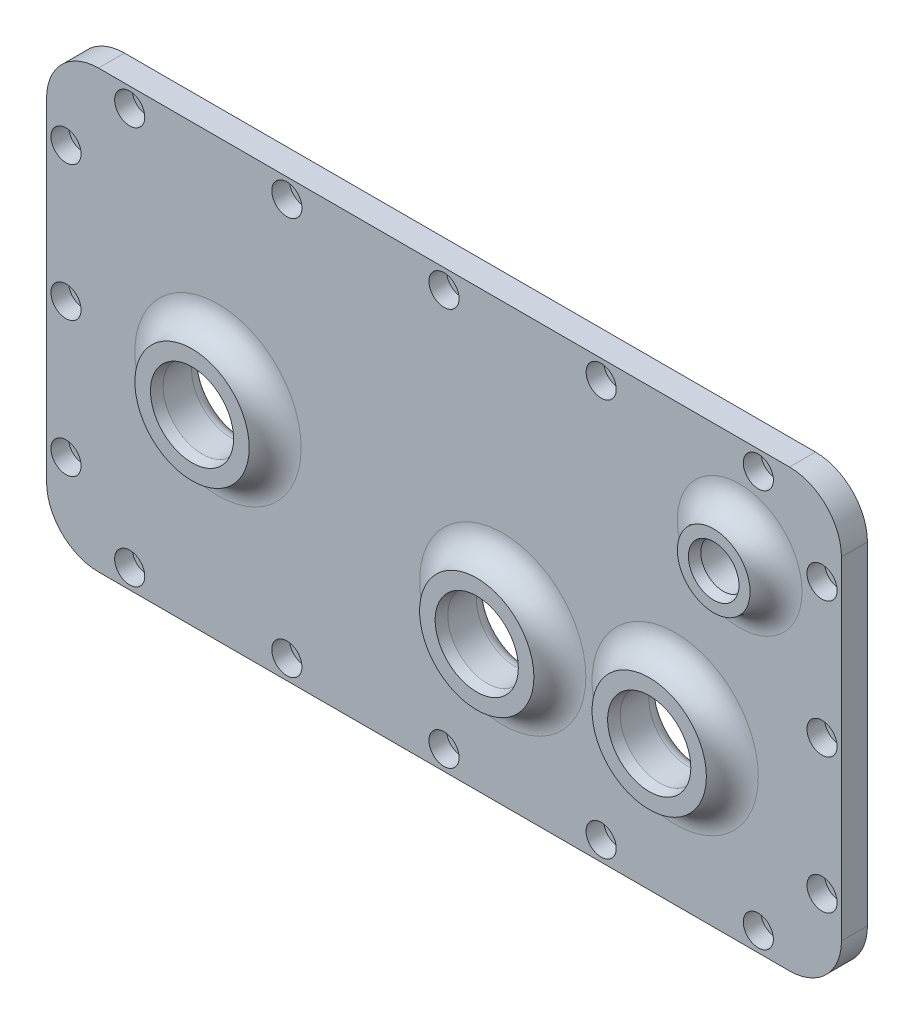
ISO-10303-21;
HEADER;
FILE_DESCRIPTION(('STEP AP214'),'2;1');
FILE_NAME('part.step','',(''),(''),'','','');
FILE_SCHEMA(('AUTOMOTIVE_DESIGN { 1 0 10303 214 1 1 1 1 }'));
ENDSEC;
DATA;
#1=APPLICATION_CONTEXT('core data for automotive mechanical design processes');
#2=APPLICATION_PROTOCOL_DEFINITION('international standard','automotive_design',2000,#1);
#3=PRODUCT_CONTEXT('',#1,'mechanical');
#4=PRODUCT('Part','Part','',(#3));
#5=PRODUCT_RELATED_PRODUCT_CATEGORY('part','',(#4));
#6=PRODUCT_DEFINITION_FORMATION('','',#4);
#7=PRODUCT_DEFINITION_CONTEXT('part definition',#1,'design');
#8=PRODUCT_DEFINITION('design','',#6,#7);
#9=PRODUCT_DEFINITION_SHAPE('','',#8);
#10=(LENGTH_UNIT() NAMED_UNIT(*) SI_UNIT(.MILLI.,.METRE.));
#11=(NAMED_UNIT(*) PLANE_ANGLE_UNIT() SI_UNIT($,.RADIAN.));
#12=(NAMED_UNIT(*) SI_UNIT($,.STERADIAN.) SOLID_ANGLE_UNIT());
#13=UNCERTAINTY_MEASURE_WITH_UNIT(LENGTH_MEASURE(1.E-05),#10,'distance_accuracy_value','');
#14=(GEOMETRIC_REPRESENTATION_CONTEXT(3) GLOBAL_UNCERTAINTY_ASSIGNED_CONTEXT((#13)) GLOBAL_UNIT_ASSIGNED_CONTEXT((#10,
#11,#12)) REPRESENTATION_CONTEXT('',''));
#15=CARTESIAN_POINT('',(0.,0.,0.));
#16=DIRECTION('',(0.,0.,1.));
#17=DIRECTION('',(1.,0.,0.));
#18=AXIS2_PLACEMENT_3D('',#15,#16,#17);
#19=CARTESIAN_POINT('',(84.455,40.64,12.7));
#20=DIRECTION('',(0.,0.,-1.));
#21=DIRECTION('',(-1.,0.,0.));
#22=AXIS2_PLACEMENT_3D('',#19,#20,#21);
#23=CYLINDRICAL_SURFACE('',#22,12.7);
#24=CARTESIAN_POINT('',(84.455,40.64,6.35));
#25=DIRECTION('',(0.,0.,1.));
#26=DIRECTION('',(1.,0.,0.));
#27=AXIS2_PLACEMENT_3D('',#24,#25,#26);
#28=CIRCLE('',#27,12.7);
#29=CARTESIAN_POINT('',(97.155,40.64,6.35));
#30=VERTEX_POINT('',#29);
#31=CARTESIAN_POINT('',(84.455,53.34,6.35));
#32=VERTEX_POINT('',#31);
#33=EDGE_CURVE('E308',#30,#32,#28,.T.);
#34=ORIENTED_EDGE('',*,*,#33,.F.);
#35=DIRECTION('',(0.,0.,-1.));
#36=VECTOR('',#35,1.);
#37=CARTESIAN_POINT('',(97.155,40.64,12.7));
#38=LINE('',#37,#36);
#39=CARTESIAN_POINT('',(97.155,40.64,0.));
#40=VERTEX_POINT('',#39);
#41=EDGE_CURVE('E539',#30,#40,#38,.T.);
#42=ORIENTED_EDGE('',*,*,#41,.T.);
#43=CARTESIAN_POINT('',(84.455,40.64,0.));
#44=DIRECTION('',(0.,0.,1.));
#45=DIRECTION('',(1.,0.,0.));
#46=AXIS2_PLACEMENT_3D('',#43,#44,#45);
#47=CIRCLE('',#46,12.7);
#48=CARTESIAN_POINT('',(84.455,53.34,0.));
#49=VERTEX_POINT('',#48);
#50=EDGE_CURVE('E515',#40,#49,#47,.T.);
#51=ORIENTED_EDGE('',*,*,#50,.T.);
#52=DIRECTION('',(0.,0.,-1.));
#53=VECTOR('',#52,1.);
#54=CARTESIAN_POINT('',(84.455,53.34,12.7));
#55=LINE('',#54,#53);
#56=EDGE_CURVE('E553',#32,#49,#55,.T.);
#57=ORIENTED_EDGE('',*,*,#56,.F.);
#58=EDGE_LOOP('',(#34,#42,#51,#57));
#59=FACE_BOUND('',#58,.T.);
#60=ADVANCED_FACE('F37',(#59),#23,.T.);
#61=CARTESIAN_POINT('',(84.455,53.34,12.7));
#62=DIRECTION('',(0.,-1.,0.));
#63=DIRECTION('',(1.,0.,0.));
#64=AXIS2_PLACEMENT_3D('',#61,#62,#63);
#65=PLANE('',#64);
#66=DIRECTION('',(-1.,0.,0.));
#67=VECTOR('',#66,1.);
#68=CARTESIAN_POINT('',(84.455,53.34,6.35));
#69=LINE('',#68,#67);
#70=CARTESIAN_POINT('',(-84.455,53.34,6.35));
#71=VERTEX_POINT('',#70);
#72=EDGE_CURVE('E306',#32,#71,#69,.T.);
#73=ORIENTED_EDGE('',*,*,#72,.F.);
#74=ORIENTED_EDGE('',*,*,#56,.T.);
#75=DIRECTION('',(-1.,0.,0.));
#76=VECTOR('',#75,1.);
#77=CARTESIAN_POINT('',(84.455,53.34,0.));
#78=LINE('',#77,#76);
#79=CARTESIAN_POINT('',(-84.455,53.34,0.));
#80=VERTEX_POINT('',#79);
#81=EDGE_CURVE('E518',#49,#80,#78,.T.);
#82=ORIENTED_EDGE('',*,*,#81,.T.);
#83=DIRECTION('',(0.,0.,-1.));
#84=VECTOR('',#83,1.);
#85=CARTESIAN_POINT('',(-84.455,53.34,12.7));
#86=LINE('',#85,#84);
#87=EDGE_CURVE('E551',#71,#80,#86,.T.);
#88=ORIENTED_EDGE('',*,*,#87,.F.);
#89=EDGE_LOOP('',(#73,#74,#82,#88));
#90=FACE_BOUND('',#89,.T.);
#91=ADVANCED_FACE('F687',(#90),#65,.F.);
#92=CARTESIAN_POINT('',(-84.455,40.64,12.7));
#93=DIRECTION('',(0.,0.,-1.));
#94=DIRECTION('',(-1.,0.,0.));
#95=AXIS2_PLACEMENT_3D('',#92,#93,#94);
#96=CYLINDRICAL_SURFACE('',#95,12.7);
#97=CARTESIAN_POINT('',(-84.455,40.64,6.35));
#98=DIRECTION('',(0.,0.,1.));
#99=DIRECTION('',(1.,0.,0.));
#100=AXIS2_PLACEMENT_3D('',#97,#98,#99);
#101=CIRCLE('',#100,12.7);
#102=CARTESIAN_POINT('',(-97.155,40.64,6.35));
#103=VERTEX_POINT('',#102);
#104=EDGE_CURVE('E304',#71,#103,#101,.T.);
#105=ORIENTED_EDGE('',*,*,#104,.F.);
#106=ORIENTED_EDGE('',*,*,#87,.T.);
#107=CARTESIAN_POINT('',(-84.455,40.64,0.));
#108=DIRECTION('',(0.,0.,1.));
#109=DIRECTION('',(1.,0.,0.));
#110=AXIS2_PLACEMENT_3D('',#107,#108,#109);
#111=CIRCLE('',#110,12.7);
#112=CARTESIAN_POINT('',(-97.155,40.64,0.));
#113=VERTEX_POINT('',#112);
#114=EDGE_CURVE('E521',#80,#113,#111,.T.);
#115=ORIENTED_EDGE('',*,*,#114,.T.);
#116=DIRECTION('',(0.,0.,-1.));
#117=VECTOR('',#116,1.);
#118=CARTESIAN_POINT('',(-97.155,40.64,12.7));
#119=LINE('',#118,#117);
#120=EDGE_CURVE('E549',#103,#113,#119,.T.);
#121=ORIENTED_EDGE('',*,*,#120,.F.);
#122=EDGE_LOOP('',(#105,#106,#115,#121));
#123=FACE_BOUND('',#122,.T.);
#124=ADVANCED_FACE('F693',(#123),#96,.T.);
#125=CARTESIAN_POINT('',(-97.155,40.64,12.7));
#126=DIRECTION('',(1.,0.,0.));
#127=DIRECTION('',(0.,0.,-1.));
#128=AXIS2_PLACEMENT_3D('',#125,#126,#127);
#129=PLANE('',#128);
#130=DIRECTION('',(0.,-1.,0.));
#131=VECTOR('',#130,1.);
#132=CARTESIAN_POINT('',(-97.155,40.64,6.35));
#133=LINE('',#132,#131);
#134=CARTESIAN_POINT('',(-97.155,-40.64,6.35));
#135=VERTEX_POINT('',#134);
#136=EDGE_CURVE('E302',#103,#135,#133,.T.);
#137=ORIENTED_EDGE('',*,*,#136,.F.);
#138=ORIENTED_EDGE('',*,*,#120,.T.);
#139=DIRECTION('',(0.,-1.,0.));
#140=VECTOR('',#139,1.);
#141=CARTESIAN_POINT('',(-97.155,40.64,0.));
#142=LINE('',#141,#140);
#143=CARTESIAN_POINT('',(-97.155,-40.64,0.));
#144=VERTEX_POINT('',#143);
#145=EDGE_CURVE('E524',#113,#144,#142,.T.);
#146=ORIENTED_EDGE('',*,*,#145,.T.);
#147=DIRECTION('',(0.,0.,-1.));
#148=VECTOR('',#147,1.);
#149=CARTESIAN_POINT('',(-97.155,-40.64,12.7));
#150=LINE('',#149,#148);
#151=EDGE_CURVE('E547',#135,#144,#150,.T.);
#152=ORIENTED_EDGE('',*,*,#151,.F.);
#153=EDGE_LOOP('',(#137,#138,#146,#152));
#154=FACE_BOUND('',#153,.T.);
#155=ADVANCED_FACE('F783',(#154),#129,.F.);
#156=CARTESIAN_POINT('',(-84.455,-40.64,12.7));
#157=DIRECTION('',(0.,0.,-1.));
#158=DIRECTION('',(-1.,0.,0.));
#159=AXIS2_PLACEMENT_3D('',#156,#157,#158);
#160=CYLINDRICAL_SURFACE('',#159,12.7);
#161=CARTESIAN_POINT('',(-84.455,-40.64,6.35));
#162=DIRECTION('',(0.,0.,1.));
#163=DIRECTION('',(1.,0.,0.));
#164=AXIS2_PLACEMENT_3D('',#161,#162,#163);
#165=CIRCLE('',#164,12.7);
#166=CARTESIAN_POINT('',(-84.455,-53.34,6.35));
#167=VERTEX_POINT('',#166);
#168=EDGE_CURVE('E300',#135,#167,#165,.T.);
#169=ORIENTED_EDGE('',*,*,#168,.F.);
#170=ORIENTED_EDGE('',*,*,#151,.T.);
#171=CARTESIAN_POINT('',(-84.455,-40.64,0.));
#172=DIRECTION('',(0.,0.,1.));
#173=DIRECTION('',(1.,0.,0.));
#174=AXIS2_PLACEMENT_3D('',#171,#172,#173);
#175=CIRCLE('',#174,12.7);
#176=CARTESIAN_POINT('',(-84.455,-53.34,0.));
#177=VERTEX_POINT('',#176);
#178=EDGE_CURVE('E527',#144,#177,#175,.T.);
#179=ORIENTED_EDGE('',*,*,#178,.T.);
#180=DIRECTION('',(0.,0.,-1.));
#181=VECTOR('',#180,1.);
#182=CARTESIAN_POINT('',(-84.455,-53.34,12.7));
#183=LINE('',#182,#181);
#184=EDGE_CURVE('E545',#167,#177,#183,.T.);
#185=ORIENTED_EDGE('',*,*,#184,.F.);
#186=EDGE_LOOP('',(#169,#170,#179,#185));
#187=FACE_BOUND('',#186,.T.);
#188=ADVANCED_FACE('F779',(#187),#160,.T.);
#189=CARTESIAN_POINT('',(-84.455,-53.34,12.7));
#190=DIRECTION('',(0.,1.,0.));
#191=DIRECTION('',(-1.,0.,0.));
#192=AXIS2_PLACEMENT_3D('',#189,#190,#191);
#193=PLANE('',#192);
#194=DIRECTION('',(1.,0.,0.));
#195=VECTOR('',#194,1.);
#196=CARTESIAN_POINT('',(-84.455,-53.34,6.35));
#197=LINE('',#196,#195);
#198=CARTESIAN_POINT('',(84.455,-53.34,6.35));
#199=VERTEX_POINT('',#198);
#200=EDGE_CURVE('E298',#167,#199,#197,.T.);
#201=ORIENTED_EDGE('',*,*,#200,.F.);
#202=ORIENTED_EDGE('',*,*,#184,.T.);
#203=DIRECTION('',(1.,0.,0.));
#204=VECTOR('',#203,1.);
#205=CARTESIAN_POINT('',(-84.455,-53.34,0.));
#206=LINE('',#205,#204);
#207=CARTESIAN_POINT('',(84.455,-53.34,0.));
#208=VERTEX_POINT('',#207);
#209=EDGE_CURVE('E530',#177,#208,#206,.T.);
#210=ORIENTED_EDGE('',*,*,#209,.T.);
#211=DIRECTION('',(0.,0.,-1.));
#212=VECTOR('',#211,1.);
#213=CARTESIAN_POINT('',(84.455,-53.34,12.7));
#214=LINE('',#213,#212);
#215=EDGE_CURVE('E543',#199,#208,#214,.T.);
#216=ORIENTED_EDGE('',*,*,#215,.F.);
#217=EDGE_LOOP('',(#201,#202,#210,#216));
#218=FACE_BOUND('',#217,.T.);
#219=ADVANCED_FACE('F775',(#218),#193,.F.);
#220=CARTESIAN_POINT('',(84.455,-40.64,12.7));
#221=DIRECTION('',(0.,0.,-1.));
#222=DIRECTION('',(-1.,0.,0.));
#223=AXIS2_PLACEMENT_3D('',#220,#221,#222);
#224=CYLINDRICAL_SURFACE('',#223,12.7);
#225=CARTESIAN_POINT('',(84.455,-40.64,6.35));
#226=DIRECTION('',(0.,0.,1.));
#227=DIRECTION('',(1.,0.,0.));
#228=AXIS2_PLACEMENT_3D('',#225,#226,#227);
#229=CIRCLE('',#228,12.7);
#230=CARTESIAN_POINT('',(97.155,-40.64,6.35));
#231=VERTEX_POINT('',#230);
#232=EDGE_CURVE('E296',#199,#231,#229,.T.);
#233=ORIENTED_EDGE('',*,*,#232,.F.);
#234=ORIENTED_EDGE('',*,*,#215,.T.);
#235=CARTESIAN_POINT('',(84.455,-40.64,0.));
#236=DIRECTION('',(0.,0.,1.));
#237=DIRECTION('',(1.,0.,0.));
#238=AXIS2_PLACEMENT_3D('',#235,#236,#237);
#239=CIRCLE('',#238,12.7);
#240=CARTESIAN_POINT('',(97.155,-40.64,0.));
#241=VERTEX_POINT('',#240);
#242=EDGE_CURVE('E533',#208,#241,#239,.T.);
#243=ORIENTED_EDGE('',*,*,#242,.T.);
#244=DIRECTION('',(0.,0.,-1.));
#245=VECTOR('',#244,1.);
#246=CARTESIAN_POINT('',(97.155,-40.64,12.7));
#247=LINE('',#246,#245);
#248=EDGE_CURVE('E541',#231,#241,#247,.T.);
#249=ORIENTED_EDGE('',*,*,#248,.F.);
#250=EDGE_LOOP('',(#233,#234,#243,#249));
#251=FACE_BOUND('',#250,.T.);
#252=ADVANCED_FACE('F771',(#251),#224,.T.);
#253=CARTESIAN_POINT('',(97.155,-40.64,12.7));
#254=DIRECTION('',(-1.,0.,0.));
#255=DIRECTION('',(0.,-1.,0.));
#256=AXIS2_PLACEMENT_3D('',#253,#254,#255);
#257=PLANE('',#256);
#258=DIRECTION('',(0.,1.,0.));
#259=VECTOR('',#258,1.);
#260=CARTESIAN_POINT('',(97.155,-40.64,6.35));
#261=LINE('',#260,#259);
#262=EDGE_CURVE('E294',#231,#30,#261,.T.);
#263=ORIENTED_EDGE('',*,*,#262,.F.);
#264=ORIENTED_EDGE('',*,*,#248,.T.);
#265=DIRECTION('',(0.,1.,0.));
#266=VECTOR('',#265,1.);
#267=CARTESIAN_POINT('',(97.155,-40.64,0.));
#268=LINE('',#267,#266);
#269=EDGE_CURVE('E536',#241,#40,#268,.T.);
#270=ORIENTED_EDGE('',*,*,#269,.T.);
#271=ORIENTED_EDGE('',*,*,#41,.F.);
#272=EDGE_LOOP('',(#263,#264,#270,#271));
#273=FACE_BOUND('',#272,.T.);
#274=ADVANCED_FACE('F756',(#273),#257,.F.);
#275=CARTESIAN_POINT('',(84.455,40.64,12.7));
#276=DIRECTION('',(0.,0.,1.));
#277=DIRECTION('',(1.,0.,0.));
#278=AXIS2_PLACEMENT_3D('',#275,#276,#277);
#279=PLANE('',#278);
#280=CARTESIAN_POINT('',(-55.245,-2.286,12.7));
#281=DIRECTION('',(0.,0.,1.));
#282=DIRECTION('',(1.,0.,0.));
#283=AXIS2_PLACEMENT_3D('',#280,#281,#282);
#284=CIRCLE('',#283,10.1664936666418);
#285=CARTESIAN_POINT('',(-45.0785063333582,-2.286,12.7));
#286=VERTEX_POINT('',#285);
#287=EDGE_CURVE('E631',#286,#286,#284,.F.);
#288=ORIENTED_EDGE('',*,*,#287,.T.);
#289=EDGE_LOOP('',(#288));
#290=FACE_BOUND('',#289,.T.);
#291=CARTESIAN_POINT('',(-55.245,-2.286,12.7));
#292=DIRECTION('',(0.,0.,1.));
#293=DIRECTION('',(1.,0.,0.));
#294=AXIS2_PLACEMENT_3D('',#291,#292,#293);
#295=CIRCLE('',#294,13.97);
#296=CARTESIAN_POINT('',(-41.275,-2.286,12.7));
#297=VERTEX_POINT('',#296);
#298=EDGE_CURVE('E245',#297,#297,#295,.T.);
#299=ORIENTED_EDGE('',*,*,#298,.T.);
#300=EDGE_LOOP('',(#299));
#301=FACE_BOUND('',#300,.T.);
#302=ADVANCED_FACE('F746',(#290,#301),#279,.T.);
#303=CARTESIAN_POINT('',(14.351,-16.002,12.7));
#304=DIRECTION('',(0.,0.,1.));
#305=DIRECTION('',(1.,0.,0.));
#306=AXIS2_PLACEMENT_3D('',#303,#304,#305);
#307=CIRCLE('',#306,10.1664936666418);
#308=CARTESIAN_POINT('',(24.5174936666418,-16.002,12.7));
#309=VERTEX_POINT('',#308);
#310=EDGE_CURVE('E625',#309,#309,#307,.F.);
#311=ORIENTED_EDGE('',*,*,#310,.T.);
#312=EDGE_LOOP('',(#311));
#313=FACE_BOUND('',#312,.T.);
#314=CARTESIAN_POINT('',(14.351,-16.002,12.7));
#315=DIRECTION('',(0.,0.,1.));
#316=DIRECTION('',(1.,0.,0.));
#317=AXIS2_PLACEMENT_3D('',#314,#315,#316);
#318=CIRCLE('',#317,13.97);
#319=CARTESIAN_POINT('',(28.321,-16.002,12.7));
#320=VERTEX_POINT('',#319);
#321=EDGE_CURVE('E242',#320,#320,#318,.T.);
#322=ORIENTED_EDGE('',*,*,#321,.T.);
#323=EDGE_LOOP('',(#322));
#324=FACE_BOUND('',#323,.T.);
#325=ADVANCED_FACE('F742',(#313,#324),#279,.T.);
#326=CARTESIAN_POINT('',(56.515,-16.002,12.7));
#327=DIRECTION('',(0.,0.,1.));
#328=DIRECTION('',(1.,0.,0.));
#329=AXIS2_PLACEMENT_3D('',#326,#327,#328);
#330=CIRCLE('',#329,10.1664936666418);
#331=CARTESIAN_POINT('',(66.6814936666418,-16.002,12.7));
#332=VERTEX_POINT('',#331);
#333=EDGE_CURVE('E619',#332,#332,#330,.F.);
#334=ORIENTED_EDGE('',*,*,#333,.T.);
#335=EDGE_LOOP('',(#334));
#336=FACE_BOUND('',#335,.T.);
#337=CARTESIAN_POINT('',(56.515,-16.002,12.7));
#338=DIRECTION('',(0.,0.,1.));
#339=DIRECTION('',(1.,0.,0.));
#340=AXIS2_PLACEMENT_3D('',#337,#338,#339);
#341=CIRCLE('',#340,13.97);
#342=CARTESIAN_POINT('',(70.485,-16.002,12.7));
#343=VERTEX_POINT('',#342);
#344=EDGE_CURVE('E239',#343,#343,#341,.T.);
#345=ORIENTED_EDGE('',*,*,#344,.T.);
#346=EDGE_LOOP('',(#345));
#347=FACE_BOUND('',#346,.T.);
#348=ADVANCED_FACE('F745',(#336,#347),#279,.T.);
#349=CARTESIAN_POINT('',(72.2757,28.4353,12.7));
#350=DIRECTION('',(0.,0.,1.));
#351=DIRECTION('',(1.,0.,0.));
#352=AXIS2_PLACEMENT_3D('',#349,#350,#351);
#353=CIRCLE('',#352,6.18490000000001);
#354=CARTESIAN_POINT('',(78.4606,28.4353,12.7));
#355=VERTEX_POINT('',#354);
#356=EDGE_CURVE('E12',#355,#355,#353,.F.);
#357=ORIENTED_EDGE('',*,*,#356,.T.);
#358=EDGE_LOOP('',(#357));
#359=FACE_BOUND('',#358,.T.);
#360=CARTESIAN_POINT('',(72.2757,28.4353,12.7));
#361=DIRECTION('',(0.,0.,1.));
#362=DIRECTION('',(1.,0.,0.));
#363=AXIS2_PLACEMENT_3D('',#360,#361,#362);
#364=CIRCLE('',#363,8.88999999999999);
#365=CARTESIAN_POINT('',(81.1657,28.4353,12.7));
#366=VERTEX_POINT('',#365);
#367=EDGE_CURVE('E236',#366,#366,#364,.T.);
#368=ORIENTED_EDGE('',*,*,#367,.T.);
#369=EDGE_LOOP('',(#368));
#370=FACE_BOUND('',#369,.T.);
#371=ADVANCED_FACE('F754',(#359,#370),#279,.T.);
#372=CARTESIAN_POINT('',(-76.835,48.5902,2.032));
#373=DIRECTION('',(0.,0.,1.));
#374=DIRECTION('',(1.,0.,0.));
#375=AXIS2_PLACEMENT_3D('',#372,#373,#374);
#376=CYLINDRICAL_SURFACE('',#375,3.683);
#377=CARTESIAN_POINT('',(-76.835,48.5902,2.032));
#378=DIRECTION('',(0.,0.,1.));
#379=DIRECTION('',(1.,0.,0.));
#380=AXIS2_PLACEMENT_3D('',#377,#378,#379);
#381=CIRCLE('',#380,3.683);
#382=CARTESIAN_POINT('',(-73.152,48.5902,2.032));
#383=VERTEX_POINT('',#382);
#384=EDGE_CURVE('E463',#383,#383,#381,.T.);
#385=ORIENTED_EDGE('',*,*,#384,.F.);
#386=EDGE_LOOP('',(#385));
#387=FACE_BOUND('',#386,.T.);
#388=CARTESIAN_POINT('',(-76.835,48.5902,6.35));
#389=DIRECTION('',(0.,0.,1.));
#390=DIRECTION('',(1.,0.,0.));
#391=AXIS2_PLACEMENT_3D('',#388,#389,#390);
#392=CIRCLE('',#391,3.683);
#393=CARTESIAN_POINT('',(-73.152,48.5902,6.35));
#394=VERTEX_POINT('',#393);
#395=EDGE_CURVE('E291',#394,#394,#392,.F.);
#396=ORIENTED_EDGE('',*,*,#395,.F.);
#397=EDGE_LOOP('',(#396));
#398=FACE_BOUND('',#397,.T.);
#399=ADVANCED_FACE('F1064',(#387,#398),#376,.F.);
#400=CARTESIAN_POINT('',(-38.4175,48.5902,2.032));
#401=DIRECTION('',(0.,0.,1.));
#402=DIRECTION('',(1.,0.,0.));
#403=AXIS2_PLACEMENT_3D('',#400,#401,#402);
#404=CYLINDRICAL_SURFACE('',#403,3.683);
#405=CARTESIAN_POINT('',(-38.4175,48.5902,2.032));
#406=DIRECTION('',(0.,0.,1.));
#407=DIRECTION('',(1.,0.,0.));
#408=AXIS2_PLACEMENT_3D('',#405,#406,#407);
#409=CIRCLE('',#408,3.683);
#410=CARTESIAN_POINT('',(-34.7345,48.5902,2.032));
#411=VERTEX_POINT('',#410);
#412=EDGE_CURVE('E459',#411,#411,#409,.T.);
#413=ORIENTED_EDGE('',*,*,#412,.F.);
#414=EDGE_LOOP('',(#413));
#415=FACE_BOUND('',#414,.T.);
#416=CARTESIAN_POINT('',(-38.4175,48.5902,6.35));
#417=DIRECTION('',(0.,0.,1.));
#418=DIRECTION('',(1.,0.,0.));
#419=AXIS2_PLACEMENT_3D('',#416,#417,#418);
#420=CIRCLE('',#419,3.683);
#421=CARTESIAN_POINT('',(-34.7345,48.5902,6.35));
#422=VERTEX_POINT('',#421);
#423=EDGE_CURVE('E288',#422,#422,#420,.F.);
#424=ORIENTED_EDGE('',*,*,#423,.F.);
#425=EDGE_LOOP('',(#424));
#426=FACE_BOUND('',#425,.T.);
#427=ADVANCED_FACE('F1057',(#415,#426),#404,.F.);
#428=CARTESIAN_POINT('',(0.,48.5902,2.032));
#429=DIRECTION('',(0.,0.,1.));
#430=DIRECTION('',(1.,0.,0.));
#431=AXIS2_PLACEMENT_3D('',#428,#429,#430);
#432=CYLINDRICAL_SURFACE('',#431,3.683);
#433=CARTESIAN_POINT('',(0.,48.5902,2.032));
#434=DIRECTION('',(0.,0.,1.));
#435=DIRECTION('',(1.,0.,0.));
#436=AXIS2_PLACEMENT_3D('',#433,#434,#435);
#437=CIRCLE('',#436,3.683);
#438=CARTESIAN_POINT('',(3.683,48.5902,2.032));
#439=VERTEX_POINT('',#438);
#440=EDGE_CURVE('E455',#439,#439,#437,.T.);
#441=ORIENTED_EDGE('',*,*,#440,.F.);
#442=EDGE_LOOP('',(#441));
#443=FACE_BOUND('',#442,.T.);
#444=CARTESIAN_POINT('',(0.,48.5902,6.35));
#445=DIRECTION('',(0.,0.,1.));
#446=DIRECTION('',(1.,0.,0.));
#447=AXIS2_PLACEMENT_3D('',#444,#445,#446);
#448=CIRCLE('',#447,3.683);
#449=CARTESIAN_POINT('',(3.683,48.5902,6.35));
#450=VERTEX_POINT('',#449);
#451=EDGE_CURVE('E285',#450,#450,#448,.F.);
#452=ORIENTED_EDGE('',*,*,#451,.F.);
#453=EDGE_LOOP('',(#452));
#454=FACE_BOUND('',#453,.T.);
#455=ADVANCED_FACE('F1049',(#443,#454),#432,.F.);
#456=CARTESIAN_POINT('',(38.4175,48.5902,2.032));
#457=DIRECTION('',(0.,0.,1.));
#458=DIRECTION('',(1.,0.,0.));
#459=AXIS2_PLACEMENT_3D('',#456,#457,#458);
#460=CYLINDRICAL_SURFACE('',#459,3.683);
#461=CARTESIAN_POINT('',(38.4175,48.5902,2.032));
#462=DIRECTION('',(0.,0.,1.));
#463=DIRECTION('',(1.,0.,0.));
#464=AXIS2_PLACEMENT_3D('',#461,#462,#463);
#465=CIRCLE('',#464,3.683);
#466=CARTESIAN_POINT('',(42.1005,48.5902,2.032));
#467=VERTEX_POINT('',#466);
#468=EDGE_CURVE('E451',#467,#467,#465,.T.);
#469=ORIENTED_EDGE('',*,*,#468,.F.);
#470=EDGE_LOOP('',(#469));
#471=FACE_BOUND('',#470,.T.);
#472=CARTESIAN_POINT('',(38.4175,48.5902,6.35));
#473=DIRECTION('',(0.,0.,1.));
#474=DIRECTION('',(1.,0.,0.));
#475=AXIS2_PLACEMENT_3D('',#472,#473,#474);
#476=CIRCLE('',#475,3.683);
#477=CARTESIAN_POINT('',(42.1005,48.5902,6.35));
#478=VERTEX_POINT('',#477);
#479=EDGE_CURVE('E282',#478,#478,#476,.F.);
#480=ORIENTED_EDGE('',*,*,#479,.F.);
#481=EDGE_LOOP('',(#480));
#482=FACE_BOUND('',#481,.T.);
#483=ADVANCED_FACE('F1041',(#471,#482),#460,.F.);
#484=CARTESIAN_POINT('',(76.835,48.5902,2.032));
#485=DIRECTION('',(0.,0.,1.));
#486=DIRECTION('',(1.,0.,0.));
#487=AXIS2_PLACEMENT_3D('',#484,#485,#486);
#488=CYLINDRICAL_SURFACE('',#487,3.683);
#489=CARTESIAN_POINT('',(76.835,48.5902,2.032));
#490=DIRECTION('',(0.,0.,1.));
#491=DIRECTION('',(1.,0.,0.));
#492=AXIS2_PLACEMENT_3D('',#489,#490,#491);
#493=CIRCLE('',#492,3.683);
#494=CARTESIAN_POINT('',(80.518,48.5902,2.032));
#495=VERTEX_POINT('',#494);
#496=EDGE_CURVE('E447',#495,#495,#493,.T.);
#497=ORIENTED_EDGE('',*,*,#496,.F.);
#498=EDGE_LOOP('',(#497));
#499=FACE_BOUND('',#498,.T.);
#500=CARTESIAN_POINT('',(76.835,48.5902,6.35));
#501=DIRECTION('',(0.,0.,1.));
#502=DIRECTION('',(1.,0.,0.));
#503=AXIS2_PLACEMENT_3D('',#500,#501,#502);
#504=CIRCLE('',#503,3.683);
#505=CARTESIAN_POINT('',(80.518,48.5902,6.35));
#506=VERTEX_POINT('',#505);
#507=EDGE_CURVE('E279',#506,#506,#504,.F.);
#508=ORIENTED_EDGE('',*,*,#507,.F.);
#509=EDGE_LOOP('',(#508));
#510=FACE_BOUND('',#509,.T.);
#511=ADVANCED_FACE('F1033',(#499,#510),#488,.F.);
#512=CARTESIAN_POINT('',(92.4052,33.02,2.032));
#513=DIRECTION('',(0.,0.,1.));
#514=DIRECTION('',(1.,0.,0.));
#515=AXIS2_PLACEMENT_3D('',#512,#513,#514);
#516=CYLINDRICAL_SURFACE('',#515,3.683);
#517=CARTESIAN_POINT('',(92.4052,33.02,2.032));
#518=DIRECTION('',(0.,0.,1.));
#519=DIRECTION('',(1.,0.,0.));
#520=AXIS2_PLACEMENT_3D('',#517,#518,#519);
#521=CIRCLE('',#520,3.683);
#522=CARTESIAN_POINT('',(96.0882,33.02,2.032));
#523=VERTEX_POINT('',#522);
#524=EDGE_CURVE('E443',#523,#523,#521,.T.);
#525=ORIENTED_EDGE('',*,*,#524,.F.);
#526=EDGE_LOOP('',(#525));
#527=FACE_BOUND('',#526,.T.);
#528=CARTESIAN_POINT('',(92.4052,33.02,6.35));
#529=DIRECTION('',(0.,0.,1.));
#530=DIRECTION('',(1.,0.,0.));
#531=AXIS2_PLACEMENT_3D('',#528,#529,#530);
#532=CIRCLE('',#531,3.683);
#533=CARTESIAN_POINT('',(96.0882,33.02,6.35));
#534=VERTEX_POINT('',#533);
#535=EDGE_CURVE('E276',#534,#534,#532,.F.);
#536=ORIENTED_EDGE('',*,*,#535,.F.);
#537=EDGE_LOOP('',(#536));
#538=FACE_BOUND('',#537,.T.);
#539=ADVANCED_FACE('F1025',(#527,#538),#516,.F.);
#540=CARTESIAN_POINT('',(92.4052,0.,2.032));
#541=DIRECTION('',(0.,0.,1.));
#542=DIRECTION('',(1.,0.,0.));
#543=AXIS2_PLACEMENT_3D('',#540,#541,#542);
#544=CYLINDRICAL_SURFACE('',#543,3.683);
#545=CARTESIAN_POINT('',(92.4052,0.,2.032));
#546=DIRECTION('',(0.,0.,1.));
#547=DIRECTION('',(1.,0.,0.));
#548=AXIS2_PLACEMENT_3D('',#545,#546,#547);
#549=CIRCLE('',#548,3.683);
#550=CARTESIAN_POINT('',(96.0882,0.,2.032));
#551=VERTEX_POINT('',#550);
#552=EDGE_CURVE('E439',#551,#551,#549,.T.);
#553=ORIENTED_EDGE('',*,*,#552,.F.);
#554=EDGE_LOOP('',(#553));
#555=FACE_BOUND('',#554,.T.);
#556=CARTESIAN_POINT('',(92.4052,0.,6.35));
#557=DIRECTION('',(0.,0.,1.));
#558=DIRECTION('',(1.,0.,0.));
#559=AXIS2_PLACEMENT_3D('',#556,#557,#558);
#560=CIRCLE('',#559,3.683);
#561=CARTESIAN_POINT('',(96.0882,0.,6.35));
#562=VERTEX_POINT('',#561);
#563=EDGE_CURVE('E273',#562,#562,#560,.F.);
#564=ORIENTED_EDGE('',*,*,#563,.F.);
#565=EDGE_LOOP('',(#564));
#566=FACE_BOUND('',#565,.T.);
#567=ADVANCED_FACE('F1017',(#555,#566),#544,.F.);
#568=CARTESIAN_POINT('',(92.4052,-33.02,2.032));
#569=DIRECTION('',(0.,0.,1.));
#570=DIRECTION('',(1.,0.,0.));
#571=AXIS2_PLACEMENT_3D('',#568,#569,#570);
#572=CYLINDRICAL_SURFACE('',#571,3.683);
#573=CARTESIAN_POINT('',(92.4052,-33.02,2.032));
#574=DIRECTION('',(0.,0.,1.));
#575=DIRECTION('',(1.,0.,0.));
#576=AXIS2_PLACEMENT_3D('',#573,#574,#575);
#577=CIRCLE('',#576,3.683);
#578=CARTESIAN_POINT('',(96.0882,-33.02,2.032));
#579=VERTEX_POINT('',#578);
#580=EDGE_CURVE('E435',#579,#579,#577,.T.);
#581=ORIENTED_EDGE('',*,*,#580,.F.);
#582=EDGE_LOOP('',(#581));
#583=FACE_BOUND('',#582,.T.);
#584=CARTESIAN_POINT('',(92.4052,-33.02,6.35));
#585=DIRECTION('',(0.,0.,1.));
#586=DIRECTION('',(1.,0.,0.));
#587=AXIS2_PLACEMENT_3D('',#584,#585,#586);
#588=CIRCLE('',#587,3.683);
#589=CARTESIAN_POINT('',(96.0882,-33.02,6.35));
#590=VERTEX_POINT('',#589);
#591=EDGE_CURVE('E270',#590,#590,#588,.F.);
#592=ORIENTED_EDGE('',*,*,#591,.F.);
#593=EDGE_LOOP('',(#592));
#594=FACE_BOUND('',#593,.T.);
#595=ADVANCED_FACE('F1009',(#583,#594),#572,.F.);
#596=CARTESIAN_POINT('',(76.835,-48.5902,2.032));
#597=DIRECTION('',(0.,0.,1.));
#598=DIRECTION('',(1.,0.,0.));
#599=AXIS2_PLACEMENT_3D('',#596,#597,#598);
#600=CYLINDRICAL_SURFACE('',#599,3.683);
#601=CARTESIAN_POINT('',(76.835,-48.5902,2.032));
#602=DIRECTION('',(0.,0.,1.));
#603=DIRECTION('',(1.,0.,0.));
#604=AXIS2_PLACEMENT_3D('',#601,#602,#603);
#605=CIRCLE('',#604,3.683);
#606=CARTESIAN_POINT('',(80.518,-48.5902,2.032));
#607=VERTEX_POINT('',#606);
#608=EDGE_CURVE('E431',#607,#607,#605,.T.);
#609=ORIENTED_EDGE('',*,*,#608,.F.);
#610=EDGE_LOOP('',(#609));
#611=FACE_BOUND('',#610,.T.);
#612=CARTESIAN_POINT('',(76.835,-48.5902,6.35));
#613=DIRECTION('',(0.,0.,1.));
#614=DIRECTION('',(1.,0.,0.));
#615=AXIS2_PLACEMENT_3D('',#612,#613,#614);
#616=CIRCLE('',#615,3.683);
#617=CARTESIAN_POINT('',(80.518,-48.5902,6.35));
#618=VERTEX_POINT('',#617);
#619=EDGE_CURVE('E267',#618,#618,#616,.F.);
#620=ORIENTED_EDGE('',*,*,#619,.F.);
#621=EDGE_LOOP('',(#620));
#622=FACE_BOUND('',#621,.T.);
#623=ADVANCED_FACE('F1001',(#611,#622),#600,.F.);
#624=CARTESIAN_POINT('',(38.4175,-48.5902,2.032));
#625=DIRECTION('',(0.,0.,1.));
#626=DIRECTION('',(1.,0.,0.));
#627=AXIS2_PLACEMENT_3D('',#624,#625,#626);
#628=CYLINDRICAL_SURFACE('',#627,3.683);
#629=CARTESIAN_POINT('',(38.4175,-48.5902,2.032));
#630=DIRECTION('',(0.,0.,1.));
#631=DIRECTION('',(1.,0.,0.));
#632=AXIS2_PLACEMENT_3D('',#629,#630,#631);
#633=CIRCLE('',#632,3.683);
#634=CARTESIAN_POINT('',(42.1005,-48.5902,2.032));
#635=VERTEX_POINT('',#634);
#636=EDGE_CURVE('E427',#635,#635,#633,.T.);
#637=ORIENTED_EDGE('',*,*,#636,.F.);
#638=EDGE_LOOP('',(#637));
#639=FACE_BOUND('',#638,.T.);
#640=CARTESIAN_POINT('',(38.4175,-48.5902,6.35));
#641=DIRECTION('',(0.,0.,1.));
#642=DIRECTION('',(1.,0.,0.));
#643=AXIS2_PLACEMENT_3D('',#640,#641,#642);
#644=CIRCLE('',#643,3.683);
#645=CARTESIAN_POINT('',(42.1005,-48.5902,6.35));
#646=VERTEX_POINT('',#645);
#647=EDGE_CURVE('E264',#646,#646,#644,.F.);
#648=ORIENTED_EDGE('',*,*,#647,.F.);
#649=EDGE_LOOP('',(#648));
#650=FACE_BOUND('',#649,.T.);
#651=ADVANCED_FACE('F993',(#639,#650),#628,.F.);
#652=CARTESIAN_POINT('',(0.,-48.5902,2.032));
#653=DIRECTION('',(0.,0.,1.));
#654=DIRECTION('',(1.,0.,0.));
#655=AXIS2_PLACEMENT_3D('',#652,#653,#654);
#656=CYLINDRICAL_SURFACE('',#655,3.683);
#657=CARTESIAN_POINT('',(0.,-48.5902,2.032));
#658=DIRECTION('',(0.,0.,1.));
#659=DIRECTION('',(1.,0.,0.));
#660=AXIS2_PLACEMENT_3D('',#657,#658,#659);
#661=CIRCLE('',#660,3.683);
#662=CARTESIAN_POINT('',(3.683,-48.5902,2.032));
#663=VERTEX_POINT('',#662);
#664=EDGE_CURVE('E423',#663,#663,#661,.T.);
#665=ORIENTED_EDGE('',*,*,#664,.F.);
#666=EDGE_LOOP('',(#665));
#667=FACE_BOUND('',#666,.T.);
#668=CARTESIAN_POINT('',(0.,-48.5902,6.35));
#669=DIRECTION('',(0.,0.,1.));
#670=DIRECTION('',(1.,0.,0.));
#671=AXIS2_PLACEMENT_3D('',#668,#669,#670);
#672=CIRCLE('',#671,3.683);
#673=CARTESIAN_POINT('',(3.683,-48.5902,6.35));
#674=VERTEX_POINT('',#673);
#675=EDGE_CURVE('E261',#674,#674,#672,.F.);
#676=ORIENTED_EDGE('',*,*,#675,.F.);
#677=EDGE_LOOP('',(#676));
#678=FACE_BOUND('',#677,.T.);
#679=ADVANCED_FACE('F985',(#667,#678),#656,.F.);
#680=CARTESIAN_POINT('',(-38.4175,-48.5902,2.032));
#681=DIRECTION('',(0.,0.,1.));
#682=DIRECTION('',(1.,0.,0.));
#683=AXIS2_PLACEMENT_3D('',#680,#681,#682);
#684=CYLINDRICAL_SURFACE('',#683,3.683);
#685=CARTESIAN_POINT('',(-38.4175,-48.5902,2.032));
#686=DIRECTION('',(0.,0.,1.));
#687=DIRECTION('',(1.,0.,0.));
#688=AXIS2_PLACEMENT_3D('',#685,#686,#687);
#689=CIRCLE('',#688,3.683);
#690=CARTESIAN_POINT('',(-34.7345,-48.5902,2.032));
#691=VERTEX_POINT('',#690);
#692=EDGE_CURVE('E419',#691,#691,#689,.T.);
#693=ORIENTED_EDGE('',*,*,#692,.F.);
#694=EDGE_LOOP('',(#693));
#695=FACE_BOUND('',#694,.T.);
#696=CARTESIAN_POINT('',(-38.4175,-48.5902,6.35));
#697=DIRECTION('',(0.,0.,1.));
#698=DIRECTION('',(1.,0.,0.));
#699=AXIS2_PLACEMENT_3D('',#696,#697,#698);
#700=CIRCLE('',#699,3.683);
#701=CARTESIAN_POINT('',(-34.7345,-48.5902,6.35));
#702=VERTEX_POINT('',#701);
#703=EDGE_CURVE('E258',#702,#702,#700,.F.);
#704=ORIENTED_EDGE('',*,*,#703,.F.);
#705=EDGE_LOOP('',(#704));
#706=FACE_BOUND('',#705,.T.);
#707=ADVANCED_FACE('F977',(#695,#706),#684,.F.);
#708=CARTESIAN_POINT('',(-76.835,-48.5902,2.032));
#709=DIRECTION('',(0.,0.,1.));
#710=DIRECTION('',(1.,0.,0.));
#711=AXIS2_PLACEMENT_3D('',#708,#709,#710);
#712=CYLINDRICAL_SURFACE('',#711,3.683);
#713=CARTESIAN_POINT('',(-76.835,-48.5902,2.032));
#714=DIRECTION('',(0.,0.,1.));
#715=DIRECTION('',(1.,0.,0.));
#716=AXIS2_PLACEMENT_3D('',#713,#714,#715);
#717=CIRCLE('',#716,3.683);
#718=CARTESIAN_POINT('',(-73.152,-48.5902,2.032));
#719=VERTEX_POINT('',#718);
#720=EDGE_CURVE('E415',#719,#719,#717,.T.);
#721=ORIENTED_EDGE('',*,*,#720,.F.);
#722=EDGE_LOOP('',(#721));
#723=FACE_BOUND('',#722,.T.);
#724=CARTESIAN_POINT('',(-76.835,-48.5902,6.35));
#725=DIRECTION('',(0.,0.,1.));
#726=DIRECTION('',(1.,0.,0.));
#727=AXIS2_PLACEMENT_3D('',#724,#725,#726);
#728=CIRCLE('',#727,3.683);
#729=CARTESIAN_POINT('',(-73.152,-48.5902,6.35));
#730=VERTEX_POINT('',#729);
#731=EDGE_CURVE('E255',#730,#730,#728,.F.);
#732=ORIENTED_EDGE('',*,*,#731,.F.);
#733=EDGE_LOOP('',(#732));
#734=FACE_BOUND('',#733,.T.);
#735=ADVANCED_FACE('F969',(#723,#734),#712,.F.);
#736=CARTESIAN_POINT('',(-92.4052,-33.02,2.032));
#737=DIRECTION('',(0.,0.,1.));
#738=DIRECTION('',(1.,0.,0.));
#739=AXIS2_PLACEMENT_3D('',#736,#737,#738);
#740=CYLINDRICAL_SURFACE('',#739,3.683);
#741=CARTESIAN_POINT('',(-92.4052,-33.02,2.032));
#742=DIRECTION('',(0.,0.,1.));
#743=DIRECTION('',(1.,0.,0.));
#744=AXIS2_PLACEMENT_3D('',#741,#742,#743);
#745=CIRCLE('',#744,3.683);
#746=CARTESIAN_POINT('',(-88.7222,-33.02,2.032));
#747=VERTEX_POINT('',#746);
#748=EDGE_CURVE('E411',#747,#747,#745,.T.);
#749=ORIENTED_EDGE('',*,*,#748,.F.);
#750=EDGE_LOOP('',(#749));
#751=FACE_BOUND('',#750,.T.);
#752=CARTESIAN_POINT('',(-92.4052,-33.02,6.35));
#753=DIRECTION('',(0.,0.,1.));
#754=DIRECTION('',(1.,0.,0.));
#755=AXIS2_PLACEMENT_3D('',#752,#753,#754);
#756=CIRCLE('',#755,3.683);
#757=CARTESIAN_POINT('',(-88.7222,-33.02,6.35));
#758=VERTEX_POINT('',#757);
#759=EDGE_CURVE('E252',#758,#758,#756,.F.);
#760=ORIENTED_EDGE('',*,*,#759,.F.);
#761=EDGE_LOOP('',(#760));
#762=FACE_BOUND('',#761,.T.);
#763=ADVANCED_FACE('F961',(#751,#762),#740,.F.);
#764=CARTESIAN_POINT('',(-92.4052,0.,2.032));
#765=DIRECTION('',(0.,0.,1.));
#766=DIRECTION('',(1.,0.,0.));
#767=AXIS2_PLACEMENT_3D('',#764,#765,#766);
#768=CYLINDRICAL_SURFACE('',#767,3.683);
#769=CARTESIAN_POINT('',(-92.4052,0.,2.032));
#770=DIRECTION('',(0.,0.,1.));
#771=DIRECTION('',(1.,0.,0.));
#772=AXIS2_PLACEMENT_3D('',#769,#770,#771);
#773=CIRCLE('',#772,3.683);
#774=CARTESIAN_POINT('',(-88.7222,0.,2.032));
#775=VERTEX_POINT('',#774);
#776=EDGE_CURVE('E407',#775,#775,#773,.T.);
#777=ORIENTED_EDGE('',*,*,#776,.F.);
#778=EDGE_LOOP('',(#777));
#779=FACE_BOUND('',#778,.T.);
#780=CARTESIAN_POINT('',(-92.4052,0.,6.35));
#781=DIRECTION('',(0.,0.,1.));
#782=DIRECTION('',(1.,0.,0.));
#783=AXIS2_PLACEMENT_3D('',#780,#781,#782);
#784=CIRCLE('',#783,3.683);
#785=CARTESIAN_POINT('',(-88.7222,0.,6.35));
#786=VERTEX_POINT('',#785);
#787=EDGE_CURVE('E249',#786,#786,#784,.F.);
#788=ORIENTED_EDGE('',*,*,#787,.F.);
#789=EDGE_LOOP('',(#788));
#790=FACE_BOUND('',#789,.T.);
#791=ADVANCED_FACE('F953',(#779,#790),#768,.F.);
#792=CARTESIAN_POINT('',(-92.4052,33.02,2.032));
#793=DIRECTION('',(0.,0.,1.));
#794=DIRECTION('',(1.,0.,0.));
#795=AXIS2_PLACEMENT_3D('',#792,#793,#794);
#796=CYLINDRICAL_SURFACE('',#795,3.683);
#797=CARTESIAN_POINT('',(-92.4052,33.02,2.032));
#798=DIRECTION('',(0.,0.,1.));
#799=DIRECTION('',(1.,0.,0.));
#800=AXIS2_PLACEMENT_3D('',#797,#798,#799);
#801=CIRCLE('',#800,3.683);
#802=CARTESIAN_POINT('',(-88.7222,33.02,2.032));
#803=VERTEX_POINT('',#802);
#804=EDGE_CURVE('E389',#803,#803,#801,.T.);
#805=ORIENTED_EDGE('',*,*,#804,.F.);
#806=EDGE_LOOP('',(#805));
#807=FACE_BOUND('',#806,.T.);
#808=CARTESIAN_POINT('',(-92.4052,33.02,6.35));
#809=DIRECTION('',(0.,0.,1.));
#810=DIRECTION('',(1.,0.,0.));
#811=AXIS2_PLACEMENT_3D('',#808,#809,#810);
#812=CIRCLE('',#811,3.683);
#813=CARTESIAN_POINT('',(-88.7222,33.02,6.35));
#814=VERTEX_POINT('',#813);
#815=EDGE_CURVE('E248',#814,#814,#812,.F.);
#816=ORIENTED_EDGE('',*,*,#815,.F.);
#817=EDGE_LOOP('',(#816));
#818=FACE_BOUND('',#817,.T.);
#819=ADVANCED_FACE('F860',(#807,#818),#796,.F.);
#820=CARTESIAN_POINT('',(84.455,40.64,0.));
#821=DIRECTION('',(0.,0.,1.));
#822=DIRECTION('',(1.,0.,0.));
#823=AXIS2_PLACEMENT_3D('',#820,#821,#822);
#824=PLANE('',#823);
#825=CARTESIAN_POINT('',(-55.245,-2.286,0.));
#826=DIRECTION('',(0.,0.,1.));
#827=DIRECTION('',(1.,0.,0.));
#828=AXIS2_PLACEMENT_3D('',#825,#826,#827);
#829=CIRCLE('',#828,12.8016);
#830=CARTESIAN_POINT('',(-42.4434,-2.286,0.));
#831=VERTEX_POINT('',#830);
#832=EDGE_CURVE('E610',#831,#831,#829,.T.);
#833=ORIENTED_EDGE('',*,*,#832,.T.);
#834=EDGE_LOOP('',(#833));
#835=FACE_BOUND('',#834,.T.);
#836=CARTESIAN_POINT('',(14.351,-16.002,0.));
#837=DIRECTION('',(0.,0.,1.));
#838=DIRECTION('',(1.,0.,0.));
#839=AXIS2_PLACEMENT_3D('',#836,#837,#838);
#840=CIRCLE('',#839,12.8016);
#841=CARTESIAN_POINT('',(27.1526,-16.002,0.));
#842=VERTEX_POINT('',#841);
#843=EDGE_CURVE('E607',#842,#842,#840,.T.);
#844=ORIENTED_EDGE('',*,*,#843,.T.);
#845=EDGE_LOOP('',(#844));
#846=FACE_BOUND('',#845,.T.);
#847=CARTESIAN_POINT('',(56.515,-16.002,0.));
#848=DIRECTION('',(0.,0.,1.));
#849=DIRECTION('',(1.,0.,0.));
#850=AXIS2_PLACEMENT_3D('',#847,#848,#849);
#851=CIRCLE('',#850,12.8016);
#852=CARTESIAN_POINT('',(69.3166,-16.002,0.));
#853=VERTEX_POINT('',#852);
#854=EDGE_CURVE('E604',#853,#853,#851,.T.);
#855=ORIENTED_EDGE('',*,*,#854,.T.);
#856=EDGE_LOOP('',(#855));
#857=FACE_BOUND('',#856,.T.);
#858=CARTESIAN_POINT('',(35.3314000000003,-14.6049999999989,0.));
#859=DIRECTION('',(0.,0.,-1.));
#860=DIRECTION('',(-1.,0.,0.));
#861=AXIS2_PLACEMENT_3D('',#858,#859,#860);
#862=CIRCLE('',#861,1.72719999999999);
#863=CARTESIAN_POINT('',(33.6042000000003,-14.6049999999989,0.));
#864=VERTEX_POINT('',#863);
#865=EDGE_CURVE('E208',#864,#864,#862,.T.);
#866=ORIENTED_EDGE('',*,*,#865,.F.);
#867=EDGE_LOOP('',(#866));
#868=FACE_BOUND('',#867,.T.);
#869=CARTESIAN_POINT('',(-11.9125999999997,-14.6049999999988,0.));
#870=DIRECTION('',(0.,0.,-1.));
#871=DIRECTION('',(-1.,0.,0.));
#872=AXIS2_PLACEMENT_3D('',#869,#870,#871);
#873=CIRCLE('',#872,1.72719999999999);
#874=CARTESIAN_POINT('',(-13.6397999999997,-14.6049999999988,0.));
#875=VERTEX_POINT('',#874);
#876=EDGE_CURVE('E207',#875,#875,#873,.T.);
#877=ORIENTED_EDGE('',*,*,#876,.F.);
#878=EDGE_LOOP('',(#877));
#879=FACE_BOUND('',#878,.T.);
#880=CARTESIAN_POINT('',(37.4650000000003,11.8872000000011,0.));
#881=DIRECTION('',(0.,0.,-1.));
#882=DIRECTION('',(-1.,0.,0.));
#883=AXIS2_PLACEMENT_3D('',#880,#881,#882);
#884=CIRCLE('',#883,1.72719999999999);
#885=CARTESIAN_POINT('',(35.7378000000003,11.8872000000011,0.));
#886=VERTEX_POINT('',#885);
#887=EDGE_CURVE('E218',#886,#886,#884,.T.);
#888=ORIENTED_EDGE('',*,*,#887,.F.);
#889=EDGE_LOOP('',(#888));
#890=FACE_BOUND('',#889,.T.);
#891=CARTESIAN_POINT('',(-64.1349999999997,24.5872000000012,0.));
#892=DIRECTION('',(0.,0.,-1.));
#893=DIRECTION('',(-1.,0.,0.));
#894=AXIS2_PLACEMENT_3D('',#891,#892,#893);
#895=CIRCLE('',#894,1.72719999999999);
#896=CARTESIAN_POINT('',(-65.8621999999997,24.5872000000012,0.));
#897=VERTEX_POINT('',#896);
#898=EDGE_CURVE('E224',#897,#897,#895,.T.);
#899=ORIENTED_EDGE('',*,*,#898,.F.);
#900=EDGE_LOOP('',(#899));
#901=FACE_BOUND('',#900,.T.);
#902=CARTESIAN_POINT('',(59.0550000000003,24.5872000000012,0.));
#903=DIRECTION('',(0.,0.,-1.));
#904=DIRECTION('',(-1.,0.,0.));
#905=AXIS2_PLACEMENT_3D('',#902,#903,#904);
#906=CIRCLE('',#905,1.72719999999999);
#907=CARTESIAN_POINT('',(57.3278000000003,24.5872000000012,0.));
#908=VERTEX_POINT('',#907);
#909=EDGE_CURVE('E230',#908,#908,#906,.T.);
#910=ORIENTED_EDGE('',*,*,#909,.F.);
#911=EDGE_LOOP('',(#910));
#912=FACE_BOUND('',#911,.T.);
#913=DIRECTION('',(1.,0.,0.));
#914=VECTOR('',#913,1.);
#915=CARTESIAN_POINT('',(74.676,30.861,0.));
#916=LINE('',#915,#914);
#917=CARTESIAN_POINT('',(-74.676,30.861,0.));
#918=VERTEX_POINT('',#917);
#919=CARTESIAN_POINT('',(63.9212233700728,30.861,0.));
#920=VERTEX_POINT('',#919);
#921=EDGE_CURVE('E314',#918,#920,#916,.T.);
#922=ORIENTED_EDGE('',*,*,#921,.T.);
#923=CARTESIAN_POINT('',(72.2757,28.4353,0.));
#924=DIRECTION('',(0.,0.,1.));
#925=DIRECTION('',(1.,0.,0.));
#926=AXIS2_PLACEMENT_3D('',#923,#924,#925);
#927=CIRCLE('',#926,8.6995);
#928=CARTESIAN_POINT('',(74.676,20.0734903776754,0.));
#929=VERTEX_POINT('',#928);
#930=EDGE_CURVE('E637',#920,#929,#927,.T.);
#931=ORIENTED_EDGE('',*,*,#930,.T.);
#932=DIRECTION('',(0.,-1.,0.));
#933=VECTOR('',#932,1.);
#934=CARTESIAN_POINT('',(74.676,30.861,0.));
#935=LINE('',#934,#933);
#936=CARTESIAN_POINT('',(74.676,-30.861,0.));
#937=VERTEX_POINT('',#936);
#938=EDGE_CURVE('E310',#929,#937,#935,.T.);
#939=ORIENTED_EDGE('',*,*,#938,.T.);
#940=DIRECTION('',(-1.,0.,0.));
#941=VECTOR('',#940,1.);
#942=CARTESIAN_POINT('',(74.676,-30.861,0.));
#943=LINE('',#942,#941);
#944=CARTESIAN_POINT('',(-74.676,-30.861,0.));
#945=VERTEX_POINT('',#944);
#946=EDGE_CURVE('E324',#937,#945,#943,.T.);
#947=ORIENTED_EDGE('',*,*,#946,.T.);
#948=DIRECTION('',(0.,1.,0.));
#949=VECTOR('',#948,1.);
#950=CARTESIAN_POINT('',(-74.676,30.861,0.));
#951=LINE('',#950,#949);
#952=EDGE_CURVE('E327',#945,#918,#951,.T.);
#953=ORIENTED_EDGE('',*,*,#952,.T.);
#954=EDGE_LOOP('',(#922,#931,#939,#947,#953));
#955=FACE_BOUND('',#954,.T.);
#956=ADVANCED_FACE('F768',(#835,#846,#857,#868,#879,#890,#901,#912,#955),#824,.F.);
#957=CARTESIAN_POINT('',(-92.4052000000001,33.02,-6.10657416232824));
#958=DIRECTION('',(0.,0.,1.));
#959=DIRECTION('',(1.,0.,0.));
#960=AXIS2_PLACEMENT_3D('',#957,#958,#959);
#961=CYLINDRICAL_SURFACE('',#960,2.15900000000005);
#962=CARTESIAN_POINT('',(-92.4052000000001,33.02,0.));
#963=DIRECTION('',(0.,0.,1.));
#964=DIRECTION('',(1.,0.,0.));
#965=AXIS2_PLACEMENT_3D('',#962,#963,#964);
#966=CIRCLE('',#965,2.15900000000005);
#967=CARTESIAN_POINT('',(-90.2462,33.02,0.));
#968=VERTEX_POINT('',#967);
#969=EDGE_CURVE('E512',#968,#968,#966,.F.);
#970=ORIENTED_EDGE('',*,*,#969,.T.);
#971=EDGE_LOOP('',(#970));
#972=FACE_BOUND('',#971,.T.);
#973=CARTESIAN_POINT('',(-92.4052000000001,33.02,2.032));
#974=DIRECTION('',(0.,0.,1.));
#975=DIRECTION('',(1.,0.,0.));
#976=AXIS2_PLACEMENT_3D('',#973,#974,#975);
#977=CIRCLE('',#976,2.15900000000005);
#978=CARTESIAN_POINT('',(-90.2462,33.02,2.032));
#979=VERTEX_POINT('',#978);
#980=EDGE_CURVE('E406',#979,#979,#977,.F.);
#981=ORIENTED_EDGE('',*,*,#980,.F.);
#982=EDGE_LOOP('',(#981));
#983=FACE_BOUND('',#982,.T.);
#984=ADVANCED_FACE('F760',(#972,#983),#961,.F.);
#985=CARTESIAN_POINT('',(-92.4052,0.,-6.10657416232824));
#986=DIRECTION('',(0.,0.,1.));
#987=DIRECTION('',(1.,0.,0.));
#988=AXIS2_PLACEMENT_3D('',#985,#986,#987);
#989=CYLINDRICAL_SURFACE('',#988,2.15899999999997);
#990=CARTESIAN_POINT('',(-92.4052,0.,0.));
#991=DIRECTION('',(0.,0.,1.));
#992=DIRECTION('',(1.,0.,0.));
#993=AXIS2_PLACEMENT_3D('',#990,#991,#992);
#994=CIRCLE('',#993,2.15899999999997);
#995=CARTESIAN_POINT('',(-90.2462,0.,0.));
#996=VERTEX_POINT('',#995);
#997=EDGE_CURVE('E509',#996,#996,#994,.F.);
#998=ORIENTED_EDGE('',*,*,#997,.T.);
#999=EDGE_LOOP('',(#998));
#1000=FACE_BOUND('',#999,.T.);
#1001=CARTESIAN_POINT('',(-92.4052,0.,2.032));
#1002=DIRECTION('',(0.,0.,1.));
#1003=DIRECTION('',(1.,0.,0.));
#1004=AXIS2_PLACEMENT_3D('',#1001,#1002,#1003);
#1005=CIRCLE('',#1004,2.15899999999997);
#1006=CARTESIAN_POINT('',(-90.2462,0.,2.032));
#1007=VERTEX_POINT('',#1006);
#1008=EDGE_CURVE('E410',#1007,#1007,#1005,.F.);
#1009=ORIENTED_EDGE('',*,*,#1008,.F.);
#1010=EDGE_LOOP('',(#1009));
#1011=FACE_BOUND('',#1010,.T.);
#1012=ADVANCED_FACE('F1125',(#1000,#1011),#989,.F.);
#1013=CARTESIAN_POINT('',(-92.4052000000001,-33.02,-6.10657416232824));
#1014=DIRECTION('',(0.,0.,1.));
#1015=DIRECTION('',(1.,0.,0.));
#1016=AXIS2_PLACEMENT_3D('',#1013,#1014,#1015);
#1017=CYLINDRICAL_SURFACE('',#1016,2.15900000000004);
#1018=CARTESIAN_POINT('',(-92.4052000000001,-33.02,0.));
#1019=DIRECTION('',(0.,0.,1.));
#1020=DIRECTION('',(1.,0.,0.));
#1021=AXIS2_PLACEMENT_3D('',#1018,#1019,#1020);
#1022=CIRCLE('',#1021,2.15900000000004);
#1023=CARTESIAN_POINT('',(-90.2462,-33.02,0.));
#1024=VERTEX_POINT('',#1023);
#1025=EDGE_CURVE('E506',#1024,#1024,#1022,.F.);
#1026=ORIENTED_EDGE('',*,*,#1025,.T.);
#1027=EDGE_LOOP('',(#1026));
#1028=FACE_BOUND('',#1027,.T.);
#1029=CARTESIAN_POINT('',(-92.4052000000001,-33.02,2.032));
#1030=DIRECTION('',(0.,0.,1.));
#1031=DIRECTION('',(1.,0.,0.));
#1032=AXIS2_PLACEMENT_3D('',#1029,#1030,#1031);
#1033=CIRCLE('',#1032,2.15900000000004);
#1034=CARTESIAN_POINT('',(-90.2462,-33.02,2.032));
#1035=VERTEX_POINT('',#1034);
#1036=EDGE_CURVE('E414',#1035,#1035,#1033,.F.);
#1037=ORIENTED_EDGE('',*,*,#1036,.F.);
#1038=EDGE_LOOP('',(#1037));
#1039=FACE_BOUND('',#1038,.T.);
#1040=ADVANCED_FACE('F1122',(#1028,#1039),#1017,.F.);
#1041=CARTESIAN_POINT('',(-76.8350000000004,-48.5902,-6.10657416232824));
#1042=DIRECTION('',(0.,0.,1.));
#1043=DIRECTION('',(1.,0.,0.));
#1044=AXIS2_PLACEMENT_3D('',#1041,#1042,#1043);
#1045=CYLINDRICAL_SURFACE('',#1044,2.15900000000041);
#1046=CARTESIAN_POINT('',(-76.8350000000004,-48.5902,0.));
#1047=DIRECTION('',(0.,0.,1.));
#1048=DIRECTION('',(1.,0.,0.));
#1049=AXIS2_PLACEMENT_3D('',#1046,#1047,#1048);
#1050=CIRCLE('',#1049,2.15900000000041);
#1051=CARTESIAN_POINT('',(-74.676,-48.5902,0.));
#1052=VERTEX_POINT('',#1051);
#1053=EDGE_CURVE('E503',#1052,#1052,#1050,.F.);
#1054=ORIENTED_EDGE('',*,*,#1053,.T.);
#1055=EDGE_LOOP('',(#1054));
#1056=FACE_BOUND('',#1055,.T.);
#1057=CARTESIAN_POINT('',(-76.8350000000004,-48.5902,2.032));
#1058=DIRECTION('',(0.,0.,1.));
#1059=DIRECTION('',(1.,0.,0.));
#1060=AXIS2_PLACEMENT_3D('',#1057,#1058,#1059);
#1061=CIRCLE('',#1060,2.15900000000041);
#1062=CARTESIAN_POINT('',(-74.676,-48.5902,2.032));
#1063=VERTEX_POINT('',#1062);
#1064=EDGE_CURVE('E418',#1063,#1063,#1061,.F.);
#1065=ORIENTED_EDGE('',*,*,#1064,.F.);
#1066=EDGE_LOOP('',(#1065));
#1067=FACE_BOUND('',#1066,.T.);
#1068=ADVANCED_FACE('F1118',(#1056,#1067),#1045,.F.);
#1069=CARTESIAN_POINT('',(-38.4175000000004,-48.5902,-6.10657416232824));
#1070=DIRECTION('',(0.,0.,1.));
#1071=DIRECTION('',(1.,0.,0.));
#1072=AXIS2_PLACEMENT_3D('',#1069,#1070,#1071);
#1073=CYLINDRICAL_SURFACE('',#1072,2.15900000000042);
#1074=CARTESIAN_POINT('',(-38.4175000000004,-48.5902,0.));
#1075=DIRECTION('',(0.,0.,1.));
#1076=DIRECTION('',(1.,0.,0.));
#1077=AXIS2_PLACEMENT_3D('',#1074,#1075,#1076);
#1078=CIRCLE('',#1077,2.15900000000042);
#1079=CARTESIAN_POINT('',(-36.2585,-48.5902,0.));
#1080=VERTEX_POINT('',#1079);
#1081=EDGE_CURVE('E500',#1080,#1080,#1078,.F.);
#1082=ORIENTED_EDGE('',*,*,#1081,.T.);
#1083=EDGE_LOOP('',(#1082));
#1084=FACE_BOUND('',#1083,.T.);
#1085=CARTESIAN_POINT('',(-38.4175000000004,-48.5902,2.032));
#1086=DIRECTION('',(0.,0.,1.));
#1087=DIRECTION('',(1.,0.,0.));
#1088=AXIS2_PLACEMENT_3D('',#1085,#1086,#1087);
#1089=CIRCLE('',#1088,2.15900000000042);
#1090=CARTESIAN_POINT('',(-36.2585,-48.5902,2.032));
#1091=VERTEX_POINT('',#1090);
#1092=EDGE_CURVE('E422',#1091,#1091,#1089,.F.);
#1093=ORIENTED_EDGE('',*,*,#1092,.F.);
#1094=EDGE_LOOP('',(#1093));
#1095=FACE_BOUND('',#1094,.T.);
#1096=ADVANCED_FACE('F1114',(#1084,#1095),#1073,.F.);
#1097=CARTESIAN_POINT('',(-4.44089209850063E-13,-48.5902,-6.10657416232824));
#1098=DIRECTION('',(0.,0.,1.));
#1099=DIRECTION('',(1.,0.,0.));
#1100=AXIS2_PLACEMENT_3D('',#1097,#1098,#1099);
#1101=CYLINDRICAL_SURFACE('',#1100,2.15900000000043);
#1102=CARTESIAN_POINT('',(-4.44089209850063E-13,-48.5902,0.));
#1103=DIRECTION('',(0.,0.,1.));
#1104=DIRECTION('',(1.,0.,0.));
#1105=AXIS2_PLACEMENT_3D('',#1102,#1103,#1104);
#1106=CIRCLE('',#1105,2.15900000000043);
#1107=CARTESIAN_POINT('',(2.15899999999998,-48.5902,0.));
#1108=VERTEX_POINT('',#1107);
#1109=EDGE_CURVE('E497',#1108,#1108,#1106,.F.);
#1110=ORIENTED_EDGE('',*,*,#1109,.T.);
#1111=EDGE_LOOP('',(#1110));
#1112=FACE_BOUND('',#1111,.T.);
#1113=CARTESIAN_POINT('',(-4.44089209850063E-13,-48.5902,2.032));
#1114=DIRECTION('',(0.,0.,1.));
#1115=DIRECTION('',(1.,0.,0.));
#1116=AXIS2_PLACEMENT_3D('',#1113,#1114,#1115);
#1117=CIRCLE('',#1116,2.15900000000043);
#1118=CARTESIAN_POINT('',(2.15899999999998,-48.5902,2.032));
#1119=VERTEX_POINT('',#1118);
#1120=EDGE_CURVE('E426',#1119,#1119,#1117,.F.);
#1121=ORIENTED_EDGE('',*,*,#1120,.F.);
#1122=EDGE_LOOP('',(#1121));
#1123=FACE_BOUND('',#1122,.T.);
#1124=ADVANCED_FACE('F1110',(#1112,#1123),#1101,.F.);
#1125=CARTESIAN_POINT('',(38.4174999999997,-48.5902,-6.10657416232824));
#1126=DIRECTION('',(0.,0.,1.));
#1127=DIRECTION('',(1.,0.,0.));
#1128=AXIS2_PLACEMENT_3D('',#1125,#1126,#1127);
#1129=CYLINDRICAL_SURFACE('',#1128,2.15900000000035);
#1130=CARTESIAN_POINT('',(38.4174999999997,-48.5902,0.));
#1131=DIRECTION('',(0.,0.,1.));
#1132=DIRECTION('',(1.,0.,0.));
#1133=AXIS2_PLACEMENT_3D('',#1130,#1131,#1132);
#1134=CIRCLE('',#1133,2.15900000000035);
#1135=CARTESIAN_POINT('',(40.5765,-48.5902,0.));
#1136=VERTEX_POINT('',#1135);
#1137=EDGE_CURVE('E494',#1136,#1136,#1134,.F.);
#1138=ORIENTED_EDGE('',*,*,#1137,.T.);
#1139=EDGE_LOOP('',(#1138));
#1140=FACE_BOUND('',#1139,.T.);
#1141=CARTESIAN_POINT('',(38.4174999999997,-48.5902,2.032));
#1142=DIRECTION('',(0.,0.,1.));
#1143=DIRECTION('',(1.,0.,0.));
#1144=AXIS2_PLACEMENT_3D('',#1141,#1142,#1143);
#1145=CIRCLE('',#1144,2.15900000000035);
#1146=CARTESIAN_POINT('',(40.5765,-48.5902,2.032));
#1147=VERTEX_POINT('',#1146);
#1148=EDGE_CURVE('E430',#1147,#1147,#1145,.F.);
#1149=ORIENTED_EDGE('',*,*,#1148,.F.);
#1150=EDGE_LOOP('',(#1149));
#1151=FACE_BOUND('',#1150,.T.);
#1152=ADVANCED_FACE('F1106',(#1140,#1151),#1129,.F.);
#1153=CARTESIAN_POINT('',(76.8349999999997,-48.5902,-6.10657416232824));
#1154=DIRECTION('',(0.,0.,1.));
#1155=DIRECTION('',(1.,0.,0.));
#1156=AXIS2_PLACEMENT_3D('',#1153,#1154,#1155);
#1157=CYLINDRICAL_SURFACE('',#1156,2.15900000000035);
#1158=CARTESIAN_POINT('',(76.8349999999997,-48.5902,0.));
#1159=DIRECTION('',(0.,0.,1.));
#1160=DIRECTION('',(1.,0.,0.));
#1161=AXIS2_PLACEMENT_3D('',#1158,#1159,#1160);
#1162=CIRCLE('',#1161,2.15900000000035);
#1163=CARTESIAN_POINT('',(78.994,-48.5902,0.));
#1164=VERTEX_POINT('',#1163);
#1165=EDGE_CURVE('E491',#1164,#1164,#1162,.F.);
#1166=ORIENTED_EDGE('',*,*,#1165,.T.);
#1167=EDGE_LOOP('',(#1166));
#1168=FACE_BOUND('',#1167,.T.);
#1169=CARTESIAN_POINT('',(76.8349999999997,-48.5902,2.032));
#1170=DIRECTION('',(0.,0.,1.));
#1171=DIRECTION('',(1.,0.,0.));
#1172=AXIS2_PLACEMENT_3D('',#1169,#1170,#1171);
#1173=CIRCLE('',#1172,2.15900000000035);
#1174=CARTESIAN_POINT('',(78.994,-48.5902,2.032));
#1175=VERTEX_POINT('',#1174);
#1176=EDGE_CURVE('E434',#1175,#1175,#1173,.F.);
#1177=ORIENTED_EDGE('',*,*,#1176,.F.);
#1178=EDGE_LOOP('',(#1177));
#1179=FACE_BOUND('',#1178,.T.);
#1180=ADVANCED_FACE('F1102',(#1168,#1179),#1157,.F.);
#1181=CARTESIAN_POINT('',(92.4052000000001,-33.02,-6.10657416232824));
#1182=DIRECTION('',(0.,0.,1.));
#1183=DIRECTION('',(1.,0.,0.));
#1184=AXIS2_PLACEMENT_3D('',#1181,#1182,#1183);
#1185=CYLINDRICAL_SURFACE('',#1184,2.15899999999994);
#1186=CARTESIAN_POINT('',(92.4052000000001,-33.02,0.));
#1187=DIRECTION('',(0.,0.,1.));
#1188=DIRECTION('',(1.,0.,0.));
#1189=AXIS2_PLACEMENT_3D('',#1186,#1187,#1188);
#1190=CIRCLE('',#1189,2.15899999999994);
#1191=CARTESIAN_POINT('',(94.5642,-33.02,0.));
#1192=VERTEX_POINT('',#1191);
#1193=EDGE_CURVE('E488',#1192,#1192,#1190,.F.);
#1194=ORIENTED_EDGE('',*,*,#1193,.T.);
#1195=EDGE_LOOP('',(#1194));
#1196=FACE_BOUND('',#1195,.T.);
#1197=CARTESIAN_POINT('',(92.4052000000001,-33.02,2.032));
#1198=DIRECTION('',(0.,0.,1.));
#1199=DIRECTION('',(1.,0.,0.));
#1200=AXIS2_PLACEMENT_3D('',#1197,#1198,#1199);
#1201=CIRCLE('',#1200,2.15899999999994);
#1202=CARTESIAN_POINT('',(94.5642,-33.02,2.032));
#1203=VERTEX_POINT('',#1202);
#1204=EDGE_CURVE('E438',#1203,#1203,#1201,.F.);
#1205=ORIENTED_EDGE('',*,*,#1204,.F.);
#1206=EDGE_LOOP('',(#1205));
#1207=FACE_BOUND('',#1206,.T.);
#1208=ADVANCED_FACE('F1098',(#1196,#1207),#1185,.F.);
#1209=CARTESIAN_POINT('',(92.4052,0.,-6.10657416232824));
#1210=DIRECTION('',(0.,0.,1.));
#1211=DIRECTION('',(1.,0.,0.));
#1212=AXIS2_PLACEMENT_3D('',#1209,#1210,#1211);
#1213=CYLINDRICAL_SURFACE('',#1212,2.15900000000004);
#1214=CARTESIAN_POINT('',(92.4052,0.,0.));
#1215=DIRECTION('',(0.,0.,1.));
#1216=DIRECTION('',(1.,0.,0.));
#1217=AXIS2_PLACEMENT_3D('',#1214,#1215,#1216);
#1218=CIRCLE('',#1217,2.15900000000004);
#1219=CARTESIAN_POINT('',(94.5642,0.,0.));
#1220=VERTEX_POINT('',#1219);
#1221=EDGE_CURVE('E485',#1220,#1220,#1218,.F.);
#1222=ORIENTED_EDGE('',*,*,#1221,.T.);
#1223=EDGE_LOOP('',(#1222));
#1224=FACE_BOUND('',#1223,.T.);
#1225=CARTESIAN_POINT('',(92.4052,0.,2.032));
#1226=DIRECTION('',(0.,0.,1.));
#1227=DIRECTION('',(1.,0.,0.));
#1228=AXIS2_PLACEMENT_3D('',#1225,#1226,#1227);
#1229=CIRCLE('',#1228,2.15900000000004);
#1230=CARTESIAN_POINT('',(94.5642,0.,2.032));
#1231=VERTEX_POINT('',#1230);
#1232=EDGE_CURVE('E442',#1231,#1231,#1229,.F.);
#1233=ORIENTED_EDGE('',*,*,#1232,.F.);
#1234=EDGE_LOOP('',(#1233));
#1235=FACE_BOUND('',#1234,.T.);
#1236=ADVANCED_FACE('F1080',(#1224,#1235),#1213,.F.);
#1237=CARTESIAN_POINT('',(92.4052000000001,33.02,-6.10657416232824));
#1238=DIRECTION('',(0.,0.,1.));
#1239=DIRECTION('',(1.,0.,0.));
#1240=AXIS2_PLACEMENT_3D('',#1237,#1238,#1239);
#1241=CYLINDRICAL_SURFACE('',#1240,2.15899999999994);
#1242=CARTESIAN_POINT('',(92.4052000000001,33.02,0.));
#1243=DIRECTION('',(0.,0.,1.));
#1244=DIRECTION('',(1.,0.,0.));
#1245=AXIS2_PLACEMENT_3D('',#1242,#1243,#1244);
#1246=CIRCLE('',#1245,2.15899999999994);
#1247=CARTESIAN_POINT('',(94.5642,33.02,0.));
#1248=VERTEX_POINT('',#1247);
#1249=EDGE_CURVE('E470',#1248,#1248,#1246,.F.);
#1250=ORIENTED_EDGE('',*,*,#1249,.T.);
#1251=EDGE_LOOP('',(#1250));
#1252=FACE_BOUND('',#1251,.T.);
#1253=CARTESIAN_POINT('',(92.4052000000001,33.02,2.032));
#1254=DIRECTION('',(0.,0.,1.));
#1255=DIRECTION('',(1.,0.,0.));
#1256=AXIS2_PLACEMENT_3D('',#1253,#1254,#1255);
#1257=CIRCLE('',#1256,2.15899999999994);
#1258=CARTESIAN_POINT('',(94.5642,33.02,2.032));
#1259=VERTEX_POINT('',#1258);
#1260=EDGE_CURVE('E446',#1259,#1259,#1257,.F.);
#1261=ORIENTED_EDGE('',*,*,#1260,.F.);
#1262=EDGE_LOOP('',(#1261));
#1263=FACE_BOUND('',#1262,.T.);
#1264=ADVANCED_FACE('F1076',(#1252,#1263),#1241,.F.);
#1265=CARTESIAN_POINT('',(76.8349999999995,48.5902,-6.10657416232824));
#1266=DIRECTION('',(0.,0.,1.));
#1267=DIRECTION('',(1.,0.,0.));
#1268=AXIS2_PLACEMENT_3D('',#1265,#1266,#1267);
#1269=CYLINDRICAL_SURFACE('',#1268,2.15900000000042);
#1270=CARTESIAN_POINT('',(76.8349999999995,48.5902,0.));
#1271=DIRECTION('',(0.,0.,1.));
#1272=DIRECTION('',(1.,0.,0.));
#1273=AXIS2_PLACEMENT_3D('',#1270,#1271,#1272);
#1274=CIRCLE('',#1273,2.15900000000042);
#1275=CARTESIAN_POINT('',(78.994,48.5902,0.));
#1276=VERTEX_POINT('',#1275);
#1277=EDGE_CURVE('E467',#1276,#1276,#1274,.F.);
#1278=ORIENTED_EDGE('',*,*,#1277,.T.);
#1279=EDGE_LOOP('',(#1278));
#1280=FACE_BOUND('',#1279,.T.);
#1281=CARTESIAN_POINT('',(76.8349999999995,48.5902,2.032));
#1282=DIRECTION('',(0.,0.,1.));
#1283=DIRECTION('',(1.,0.,0.));
#1284=AXIS2_PLACEMENT_3D('',#1281,#1282,#1283);
#1285=CIRCLE('',#1284,2.15900000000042);
#1286=CARTESIAN_POINT('',(78.994,48.5902,2.032));
#1287=VERTEX_POINT('',#1286);
#1288=EDGE_CURVE('E450',#1287,#1287,#1285,.F.);
#1289=ORIENTED_EDGE('',*,*,#1288,.F.);
#1290=EDGE_LOOP('',(#1289));
#1291=FACE_BOUND('',#1290,.T.);
#1292=ADVANCED_FACE('F1072',(#1280,#1291),#1269,.F.);
#1293=CARTESIAN_POINT('',(38.4174999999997,48.5902,-6.10657416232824));
#1294=DIRECTION('',(0.,0.,1.));
#1295=DIRECTION('',(1.,0.,0.));
#1296=AXIS2_PLACEMENT_3D('',#1293,#1294,#1295);
#1297=CYLINDRICAL_SURFACE('',#1296,2.15900000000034);
#1298=CARTESIAN_POINT('',(38.4174999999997,48.5902,0.));
#1299=DIRECTION('',(0.,0.,1.));
#1300=DIRECTION('',(1.,0.,0.));
#1301=AXIS2_PLACEMENT_3D('',#1298,#1299,#1300);
#1302=CIRCLE('',#1301,2.15900000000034);
#1303=CARTESIAN_POINT('',(40.5765,48.5902,0.));
#1304=VERTEX_POINT('',#1303);
#1305=EDGE_CURVE('E473',#1304,#1304,#1302,.F.);
#1306=ORIENTED_EDGE('',*,*,#1305,.T.);
#1307=EDGE_LOOP('',(#1306));
#1308=FACE_BOUND('',#1307,.T.);
#1309=CARTESIAN_POINT('',(38.4174999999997,48.5902,2.032));
#1310=DIRECTION('',(0.,0.,1.));
#1311=DIRECTION('',(1.,0.,0.));
#1312=AXIS2_PLACEMENT_3D('',#1309,#1310,#1311);
#1313=CIRCLE('',#1312,2.15900000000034);
#1314=CARTESIAN_POINT('',(40.5765,48.5902,2.032));
#1315=VERTEX_POINT('',#1314);
#1316=EDGE_CURVE('E454',#1315,#1315,#1313,.F.);
#1317=ORIENTED_EDGE('',*,*,#1316,.F.);
#1318=EDGE_LOOP('',(#1317));
#1319=FACE_BOUND('',#1318,.T.);
#1320=ADVANCED_FACE('F1075',(#1308,#1319),#1297,.F.);
#1321=CARTESIAN_POINT('',(-4.44089209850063E-13,48.5902,-6.10657416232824));
#1322=DIRECTION('',(0.,0.,1.));
#1323=DIRECTION('',(1.,0.,0.));
#1324=AXIS2_PLACEMENT_3D('',#1321,#1322,#1323);
#1325=CYLINDRICAL_SURFACE('',#1324,2.15900000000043);
#1326=CARTESIAN_POINT('',(-4.44089209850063E-13,48.5902,0.));
#1327=DIRECTION('',(0.,0.,1.));
#1328=DIRECTION('',(1.,0.,0.));
#1329=AXIS2_PLACEMENT_3D('',#1326,#1327,#1328);
#1330=CIRCLE('',#1329,2.15900000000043);
#1331=CARTESIAN_POINT('',(2.15899999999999,48.5902,0.));
#1332=VERTEX_POINT('',#1331);
#1333=EDGE_CURVE('E476',#1332,#1332,#1330,.F.);
#1334=ORIENTED_EDGE('',*,*,#1333,.T.);
#1335=EDGE_LOOP('',(#1334));
#1336=FACE_BOUND('',#1335,.T.);
#1337=CARTESIAN_POINT('',(-4.44089209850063E-13,48.5902,2.032));
#1338=DIRECTION('',(0.,0.,1.));
#1339=DIRECTION('',(1.,0.,0.));
#1340=AXIS2_PLACEMENT_3D('',#1337,#1338,#1339);
#1341=CIRCLE('',#1340,2.15900000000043);
#1342=CARTESIAN_POINT('',(2.15899999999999,48.5902,2.032));
#1343=VERTEX_POINT('',#1342);
#1344=EDGE_CURVE('E458',#1343,#1343,#1341,.F.);
#1345=ORIENTED_EDGE('',*,*,#1344,.F.);
#1346=EDGE_LOOP('',(#1345));
#1347=FACE_BOUND('',#1346,.T.);
#1348=ADVANCED_FACE('F1084',(#1336,#1347),#1325,.F.);
#1349=CARTESIAN_POINT('',(-38.4175000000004,48.5902,-6.10657416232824));
#1350=DIRECTION('',(0.,0.,1.));
#1351=DIRECTION('',(1.,0.,0.));
#1352=AXIS2_PLACEMENT_3D('',#1349,#1350,#1351);
#1353=CYLINDRICAL_SURFACE('',#1352,2.15900000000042);
#1354=CARTESIAN_POINT('',(-38.4175000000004,48.5902,0.));
#1355=DIRECTION('',(0.,0.,1.));
#1356=DIRECTION('',(1.,0.,0.));
#1357=AXIS2_PLACEMENT_3D('',#1354,#1355,#1356);
#1358=CIRCLE('',#1357,2.15900000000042);
#1359=CARTESIAN_POINT('',(-36.2585,48.5902,0.));
#1360=VERTEX_POINT('',#1359);
#1361=EDGE_CURVE('E479',#1360,#1360,#1358,.F.);
#1362=ORIENTED_EDGE('',*,*,#1361,.T.);
#1363=EDGE_LOOP('',(#1362));
#1364=FACE_BOUND('',#1363,.T.);
#1365=CARTESIAN_POINT('',(-38.4175000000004,48.5902,2.032));
#1366=DIRECTION('',(0.,0.,1.));
#1367=DIRECTION('',(1.,0.,0.));
#1368=AXIS2_PLACEMENT_3D('',#1365,#1366,#1367);
#1369=CIRCLE('',#1368,2.15900000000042);
#1370=CARTESIAN_POINT('',(-36.2585,48.5902,2.032));
#1371=VERTEX_POINT('',#1370);
#1372=EDGE_CURVE('E462',#1371,#1371,#1369,.F.);
#1373=ORIENTED_EDGE('',*,*,#1372,.F.);
#1374=EDGE_LOOP('',(#1373));
#1375=FACE_BOUND('',#1374,.T.);
#1376=ADVANCED_FACE('F1088',(#1364,#1375),#1353,.F.);
#1377=CARTESIAN_POINT('',(-76.8350000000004,48.5902,-6.10657416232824));
#1378=DIRECTION('',(0.,0.,1.));
#1379=DIRECTION('',(1.,0.,0.));
#1380=AXIS2_PLACEMENT_3D('',#1377,#1378,#1379);
#1381=CYLINDRICAL_SURFACE('',#1380,2.15900000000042);
#1382=CARTESIAN_POINT('',(-76.8350000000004,48.5902,0.));
#1383=DIRECTION('',(0.,0.,1.));
#1384=DIRECTION('',(1.,0.,0.));
#1385=AXIS2_PLACEMENT_3D('',#1382,#1383,#1384);
#1386=CIRCLE('',#1385,2.15900000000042);
#1387=CARTESIAN_POINT('',(-74.676,48.5902,0.));
#1388=VERTEX_POINT('',#1387);
#1389=EDGE_CURVE('E482',#1388,#1388,#1386,.F.);
#1390=ORIENTED_EDGE('',*,*,#1389,.T.);
#1391=EDGE_LOOP('',(#1390));
#1392=FACE_BOUND('',#1391,.T.);
#1393=CARTESIAN_POINT('',(-76.8350000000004,48.5902,2.032));
#1394=DIRECTION('',(0.,0.,1.));
#1395=DIRECTION('',(1.,0.,0.));
#1396=AXIS2_PLACEMENT_3D('',#1393,#1394,#1395);
#1397=CIRCLE('',#1396,2.15900000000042);
#1398=CARTESIAN_POINT('',(-74.676,48.5902,2.032));
#1399=VERTEX_POINT('',#1398);
#1400=EDGE_CURVE('E466',#1399,#1399,#1397,.F.);
#1401=ORIENTED_EDGE('',*,*,#1400,.F.);
#1402=EDGE_LOOP('',(#1401));
#1403=FACE_BOUND('',#1402,.T.);
#1404=ADVANCED_FACE('F766',(#1392,#1403),#1381,.F.);
#1405=DIRECTION('',(0.,-1.,0.));
#1406=VECTOR('',#1405,1.);
#1407=CARTESIAN_POINT('',(81.026,30.861,0.));
#1408=LINE('',#1407,#1406);
#1409=CARTESIAN_POINT('',(81.026,30.861,0.));
#1410=VERTEX_POINT('',#1409);
#1411=CARTESIAN_POINT('',(81.026,-30.861,0.));
#1412=VERTEX_POINT('',#1411);
#1413=EDGE_CURVE('E367',#1410,#1412,#1408,.T.);
#1414=ORIENTED_EDGE('',*,*,#1413,.F.);
#1415=CARTESIAN_POINT('',(74.676,30.861,0.));
#1416=DIRECTION('',(0.,0.,-1.));
#1417=DIRECTION('',(1.,0.,0.));
#1418=AXIS2_PLACEMENT_3D('',#1415,#1416,#1417);
#1419=CIRCLE('',#1418,6.35);
#1420=CARTESIAN_POINT('',(74.676,37.211,0.));
#1421=VERTEX_POINT('',#1420);
#1422=EDGE_CURVE('E334',#1421,#1410,#1419,.T.);
#1423=ORIENTED_EDGE('',*,*,#1422,.F.);
#1424=DIRECTION('',(1.,0.,0.));
#1425=VECTOR('',#1424,1.);
#1426=CARTESIAN_POINT('',(74.676,37.211,0.));
#1427=LINE('',#1426,#1425);
#1428=CARTESIAN_POINT('',(-74.676,37.211,0.));
#1429=VERTEX_POINT('',#1428);
#1430=EDGE_CURVE('E344',#1429,#1421,#1427,.T.);
#1431=ORIENTED_EDGE('',*,*,#1430,.F.);
#1432=CARTESIAN_POINT('',(-74.676,30.861,0.));
#1433=DIRECTION('',(0.,0.,-1.));
#1434=DIRECTION('',(-1.,0.,0.));
#1435=AXIS2_PLACEMENT_3D('',#1432,#1433,#1434);
#1436=CIRCLE('',#1435,6.35);
#1437=CARTESIAN_POINT('',(-81.026,30.861,0.));
#1438=VERTEX_POINT('',#1437);
#1439=EDGE_CURVE('E382',#1438,#1429,#1436,.T.);
#1440=ORIENTED_EDGE('',*,*,#1439,.F.);
#1441=DIRECTION('',(0.,1.,0.));
#1442=VECTOR('',#1441,1.);
#1443=CARTESIAN_POINT('',(-81.026,30.861,0.));
#1444=LINE('',#1443,#1442);
#1445=CARTESIAN_POINT('',(-81.026,-30.861,0.));
#1446=VERTEX_POINT('',#1445);
#1447=EDGE_CURVE('E379',#1446,#1438,#1444,.T.);
#1448=ORIENTED_EDGE('',*,*,#1447,.F.);
#1449=CARTESIAN_POINT('',(-74.676,-30.861,0.));
#1450=DIRECTION('',(0.,0.,-1.));
#1451=DIRECTION('',(-1.,0.,0.));
#1452=AXIS2_PLACEMENT_3D('',#1449,#1450,#1451);
#1453=CIRCLE('',#1452,6.35);
#1454=CARTESIAN_POINT('',(-74.676,-37.211,0.));
#1455=VERTEX_POINT('',#1454);
#1456=EDGE_CURVE('E376',#1455,#1446,#1453,.T.);
#1457=ORIENTED_EDGE('',*,*,#1456,.F.);
#1458=DIRECTION('',(-1.,0.,0.));
#1459=VECTOR('',#1458,1.);
#1460=CARTESIAN_POINT('',(74.676,-37.211,0.));
#1461=LINE('',#1460,#1459);
#1462=CARTESIAN_POINT('',(74.676,-37.211,0.));
#1463=VERTEX_POINT('',#1462);
#1464=EDGE_CURVE('E373',#1463,#1455,#1461,.T.);
#1465=ORIENTED_EDGE('',*,*,#1464,.F.);
#1466=CARTESIAN_POINT('',(74.676,-30.861,0.));
#1467=DIRECTION('',(0.,0.,-1.));
#1468=DIRECTION('',(1.,0.,0.));
#1469=AXIS2_PLACEMENT_3D('',#1466,#1467,#1468);
#1470=CIRCLE('',#1469,6.34999999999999);
#1471=EDGE_CURVE('E370',#1412,#1463,#1470,.T.);
#1472=ORIENTED_EDGE('',*,*,#1471,.F.);
#1473=EDGE_LOOP('',(#1414,#1423,#1431,#1440,#1448,#1457,#1465,#1472));
#1474=FACE_BOUND('',#1473,.T.);
#1475=ORIENTED_EDGE('',*,*,#1277,.F.);
#1476=EDGE_LOOP('',(#1475));
#1477=FACE_BOUND('',#1476,.T.);
#1478=ORIENTED_EDGE('',*,*,#1249,.F.);
#1479=EDGE_LOOP('',(#1478));
#1480=FACE_BOUND('',#1479,.T.);
#1481=ORIENTED_EDGE('',*,*,#1305,.F.);
#1482=EDGE_LOOP('',(#1481));
#1483=FACE_BOUND('',#1482,.T.);
#1484=ORIENTED_EDGE('',*,*,#1333,.F.);
#1485=EDGE_LOOP('',(#1484));
#1486=FACE_BOUND('',#1485,.T.);
#1487=ORIENTED_EDGE('',*,*,#1361,.F.);
#1488=EDGE_LOOP('',(#1487));
#1489=FACE_BOUND('',#1488,.T.);
#1490=ORIENTED_EDGE('',*,*,#1389,.F.);
#1491=EDGE_LOOP('',(#1490));
#1492=FACE_BOUND('',#1491,.T.);
#1493=ORIENTED_EDGE('',*,*,#1221,.F.);
#1494=EDGE_LOOP('',(#1493));
#1495=FACE_BOUND('',#1494,.T.);
#1496=ORIENTED_EDGE('',*,*,#1193,.F.);
#1497=EDGE_LOOP('',(#1496));
#1498=FACE_BOUND('',#1497,.T.);
#1499=ORIENTED_EDGE('',*,*,#1165,.F.);
#1500=EDGE_LOOP('',(#1499));
#1501=FACE_BOUND('',#1500,.T.);
#1502=ORIENTED_EDGE('',*,*,#1137,.F.);
#1503=EDGE_LOOP('',(#1502));
#1504=FACE_BOUND('',#1503,.T.);
#1505=ORIENTED_EDGE('',*,*,#1109,.F.);
#1506=EDGE_LOOP('',(#1505));
#1507=FACE_BOUND('',#1506,.T.);
#1508=ORIENTED_EDGE('',*,*,#1081,.F.);
#1509=EDGE_LOOP('',(#1508));
#1510=FACE_BOUND('',#1509,.T.);
#1511=ORIENTED_EDGE('',*,*,#1053,.F.);
#1512=EDGE_LOOP('',(#1511));
#1513=FACE_BOUND('',#1512,.T.);
#1514=ORIENTED_EDGE('',*,*,#1025,.F.);
#1515=EDGE_LOOP('',(#1514));
#1516=FACE_BOUND('',#1515,.T.);
#1517=ORIENTED_EDGE('',*,*,#997,.F.);
#1518=EDGE_LOOP('',(#1517));
#1519=FACE_BOUND('',#1518,.T.);
#1520=ORIENTED_EDGE('',*,*,#969,.F.);
#1521=EDGE_LOOP('',(#1520));
#1522=FACE_BOUND('',#1521,.T.);
#1523=ORIENTED_EDGE('',*,*,#50,.F.);
#1524=ORIENTED_EDGE('',*,*,#269,.F.);
#1525=ORIENTED_EDGE('',*,*,#242,.F.);
#1526=ORIENTED_EDGE('',*,*,#209,.F.);
#1527=ORIENTED_EDGE('',*,*,#178,.F.);
#1528=ORIENTED_EDGE('',*,*,#145,.F.);
#1529=ORIENTED_EDGE('',*,*,#114,.F.);
#1530=ORIENTED_EDGE('',*,*,#81,.F.);
#1531=EDGE_LOOP('',(#1523,#1524,#1525,#1526,#1527,#1528,#1529,#1530));
#1532=FACE_BOUND('',#1531,.T.);
#1533=ADVANCED_FACE('F762',(#1474,#1477,#1480,#1483,#1486,#1489,#1492,#1495,#1498,#1501,#1504,
#1507,#1510,#1513,#1516,#1519,#1522,#1532),#824,.F.);
#1534=CARTESIAN_POINT('',(-76.835,48.5902,2.032));
#1535=DIRECTION('',(0.,0.,1.));
#1536=DIRECTION('',(1.,0.,0.));
#1537=AXIS2_PLACEMENT_3D('',#1534,#1535,#1536);
#1538=PLANE('',#1537);
#1539=ORIENTED_EDGE('',*,*,#384,.T.);
#1540=EDGE_LOOP('',(#1539));
#1541=FACE_BOUND('',#1540,.T.);
#1542=ORIENTED_EDGE('',*,*,#1400,.T.);
#1543=EDGE_LOOP('',(#1542));
#1544=FACE_BOUND('',#1543,.T.);
#1545=ADVANCED_FACE('F765',(#1541,#1544),#1538,.T.);
#1546=CARTESIAN_POINT('',(-38.4175,48.5902,2.032));
#1547=DIRECTION('',(0.,0.,1.));
#1548=DIRECTION('',(1.,0.,0.));
#1549=AXIS2_PLACEMENT_3D('',#1546,#1547,#1548);
#1550=PLANE('',#1549);
#1551=ORIENTED_EDGE('',*,*,#412,.T.);
#1552=EDGE_LOOP('',(#1551));
#1553=FACE_BOUND('',#1552,.T.);
#1554=ORIENTED_EDGE('',*,*,#1372,.T.);
#1555=EDGE_LOOP('',(#1554));
#1556=FACE_BOUND('',#1555,.T.);
#1557=ADVANCED_FACE('F1053',(#1553,#1556),#1550,.T.);
#1558=CARTESIAN_POINT('',(0.,48.5902,2.032));
#1559=DIRECTION('',(0.,0.,1.));
#1560=DIRECTION('',(1.,0.,0.));
#1561=AXIS2_PLACEMENT_3D('',#1558,#1559,#1560);
#1562=PLANE('',#1561);
#1563=ORIENTED_EDGE('',*,*,#440,.T.);
#1564=EDGE_LOOP('',(#1563));
#1565=FACE_BOUND('',#1564,.T.);
#1566=ORIENTED_EDGE('',*,*,#1344,.T.);
#1567=EDGE_LOOP('',(#1566));
#1568=FACE_BOUND('',#1567,.T.);
#1569=ADVANCED_FACE('F1045',(#1565,#1568),#1562,.T.);
#1570=CARTESIAN_POINT('',(38.4175,48.5902,2.032));
#1571=DIRECTION('',(0.,0.,1.));
#1572=DIRECTION('',(1.,0.,0.));
#1573=AXIS2_PLACEMENT_3D('',#1570,#1571,#1572);
#1574=PLANE('',#1573);
#1575=ORIENTED_EDGE('',*,*,#468,.T.);
#1576=EDGE_LOOP('',(#1575));
#1577=FACE_BOUND('',#1576,.T.);
#1578=ORIENTED_EDGE('',*,*,#1316,.T.);
#1579=EDGE_LOOP('',(#1578));
#1580=FACE_BOUND('',#1579,.T.);
#1581=ADVANCED_FACE('F1037',(#1577,#1580),#1574,.T.);
#1582=CARTESIAN_POINT('',(76.835,48.5902,2.032));
#1583=DIRECTION('',(0.,0.,1.));
#1584=DIRECTION('',(1.,0.,0.));
#1585=AXIS2_PLACEMENT_3D('',#1582,#1583,#1584);
#1586=PLANE('',#1585);
#1587=ORIENTED_EDGE('',*,*,#496,.T.);
#1588=EDGE_LOOP('',(#1587));
#1589=FACE_BOUND('',#1588,.T.);
#1590=ORIENTED_EDGE('',*,*,#1288,.T.);
#1591=EDGE_LOOP('',(#1590));
#1592=FACE_BOUND('',#1591,.T.);
#1593=ADVANCED_FACE('F1029',(#1589,#1592),#1586,.T.);
#1594=CARTESIAN_POINT('',(92.4052,33.02,2.032));
#1595=DIRECTION('',(0.,0.,1.));
#1596=DIRECTION('',(1.,0.,0.));
#1597=AXIS2_PLACEMENT_3D('',#1594,#1595,#1596);
#1598=PLANE('',#1597);
#1599=ORIENTED_EDGE('',*,*,#524,.T.);
#1600=EDGE_LOOP('',(#1599));
#1601=FACE_BOUND('',#1600,.T.);
#1602=ORIENTED_EDGE('',*,*,#1260,.T.);
#1603=EDGE_LOOP('',(#1602));
#1604=FACE_BOUND('',#1603,.T.);
#1605=ADVANCED_FACE('F1021',(#1601,#1604),#1598,.T.);
#1606=CARTESIAN_POINT('',(92.4052,0.,2.032));
#1607=DIRECTION('',(0.,0.,1.));
#1608=DIRECTION('',(1.,0.,0.));
#1609=AXIS2_PLACEMENT_3D('',#1606,#1607,#1608);
#1610=PLANE('',#1609);
#1611=ORIENTED_EDGE('',*,*,#552,.T.);
#1612=EDGE_LOOP('',(#1611));
#1613=FACE_BOUND('',#1612,.T.);
#1614=ORIENTED_EDGE('',*,*,#1232,.T.);
#1615=EDGE_LOOP('',(#1614));
#1616=FACE_BOUND('',#1615,.T.);
#1617=ADVANCED_FACE('F1013',(#1613,#1616),#1610,.T.);
#1618=CARTESIAN_POINT('',(92.4052,-33.02,2.032));
#1619=DIRECTION('',(0.,0.,1.));
#1620=DIRECTION('',(1.,0.,0.));
#1621=AXIS2_PLACEMENT_3D('',#1618,#1619,#1620);
#1622=PLANE('',#1621);
#1623=ORIENTED_EDGE('',*,*,#580,.T.);
#1624=EDGE_LOOP('',(#1623));
#1625=FACE_BOUND('',#1624,.T.);
#1626=ORIENTED_EDGE('',*,*,#1204,.T.);
#1627=EDGE_LOOP('',(#1626));
#1628=FACE_BOUND('',#1627,.T.);
#1629=ADVANCED_FACE('F1005',(#1625,#1628),#1622,.T.);
#1630=CARTESIAN_POINT('',(76.835,-48.5902,2.032));
#1631=DIRECTION('',(0.,0.,1.));
#1632=DIRECTION('',(1.,0.,0.));
#1633=AXIS2_PLACEMENT_3D('',#1630,#1631,#1632);
#1634=PLANE('',#1633);
#1635=ORIENTED_EDGE('',*,*,#608,.T.);
#1636=EDGE_LOOP('',(#1635));
#1637=FACE_BOUND('',#1636,.T.);
#1638=ORIENTED_EDGE('',*,*,#1176,.T.);
#1639=EDGE_LOOP('',(#1638));
#1640=FACE_BOUND('',#1639,.T.);
#1641=ADVANCED_FACE('F997',(#1637,#1640),#1634,.T.);
#1642=CARTESIAN_POINT('',(38.4175,-48.5902,2.032));
#1643=DIRECTION('',(0.,0.,1.));
#1644=DIRECTION('',(1.,0.,0.));
#1645=AXIS2_PLACEMENT_3D('',#1642,#1643,#1644);
#1646=PLANE('',#1645);
#1647=ORIENTED_EDGE('',*,*,#636,.T.);
#1648=EDGE_LOOP('',(#1647));
#1649=FACE_BOUND('',#1648,.T.);
#1650=ORIENTED_EDGE('',*,*,#1148,.T.);
#1651=EDGE_LOOP('',(#1650));
#1652=FACE_BOUND('',#1651,.T.);
#1653=ADVANCED_FACE('F989',(#1649,#1652),#1646,.T.);
#1654=CARTESIAN_POINT('',(0.,-48.5902,2.032));
#1655=DIRECTION('',(0.,0.,1.));
#1656=DIRECTION('',(1.,0.,0.));
#1657=AXIS2_PLACEMENT_3D('',#1654,#1655,#1656);
#1658=PLANE('',#1657);
#1659=ORIENTED_EDGE('',*,*,#664,.T.);
#1660=EDGE_LOOP('',(#1659));
#1661=FACE_BOUND('',#1660,.T.);
#1662=ORIENTED_EDGE('',*,*,#1120,.T.);
#1663=EDGE_LOOP('',(#1662));
#1664=FACE_BOUND('',#1663,.T.);
#1665=ADVANCED_FACE('F981',(#1661,#1664),#1658,.T.);
#1666=CARTESIAN_POINT('',(-38.4175,-48.5902,2.032));
#1667=DIRECTION('',(0.,0.,1.));
#1668=DIRECTION('',(1.,0.,0.));
#1669=AXIS2_PLACEMENT_3D('',#1666,#1667,#1668);
#1670=PLANE('',#1669);
#1671=ORIENTED_EDGE('',*,*,#692,.T.);
#1672=EDGE_LOOP('',(#1671));
#1673=FACE_BOUND('',#1672,.T.);
#1674=ORIENTED_EDGE('',*,*,#1092,.T.);
#1675=EDGE_LOOP('',(#1674));
#1676=FACE_BOUND('',#1675,.T.);
#1677=ADVANCED_FACE('F973',(#1673,#1676),#1670,.T.);
#1678=CARTESIAN_POINT('',(-76.835,-48.5902,2.032));
#1679=DIRECTION('',(0.,0.,1.));
#1680=DIRECTION('',(1.,0.,0.));
#1681=AXIS2_PLACEMENT_3D('',#1678,#1679,#1680);
#1682=PLANE('',#1681);
#1683=ORIENTED_EDGE('',*,*,#720,.T.);
#1684=EDGE_LOOP('',(#1683));
#1685=FACE_BOUND('',#1684,.T.);
#1686=ORIENTED_EDGE('',*,*,#1064,.T.);
#1687=EDGE_LOOP('',(#1686));
#1688=FACE_BOUND('',#1687,.T.);
#1689=ADVANCED_FACE('F965',(#1685,#1688),#1682,.T.);
#1690=CARTESIAN_POINT('',(-92.4052,-33.02,2.032));
#1691=DIRECTION('',(0.,0.,1.));
#1692=DIRECTION('',(1.,0.,0.));
#1693=AXIS2_PLACEMENT_3D('',#1690,#1691,#1692);
#1694=PLANE('',#1693);
#1695=ORIENTED_EDGE('',*,*,#748,.T.);
#1696=EDGE_LOOP('',(#1695));
#1697=FACE_BOUND('',#1696,.T.);
#1698=ORIENTED_EDGE('',*,*,#1036,.T.);
#1699=EDGE_LOOP('',(#1698));
#1700=FACE_BOUND('',#1699,.T.);
#1701=ADVANCED_FACE('F957',(#1697,#1700),#1694,.T.);
#1702=CARTESIAN_POINT('',(-92.4052,0.,2.032));
#1703=DIRECTION('',(0.,0.,1.));
#1704=DIRECTION('',(1.,0.,0.));
#1705=AXIS2_PLACEMENT_3D('',#1702,#1703,#1704);
#1706=PLANE('',#1705);
#1707=ORIENTED_EDGE('',*,*,#776,.T.);
#1708=EDGE_LOOP('',(#1707));
#1709=FACE_BOUND('',#1708,.T.);
#1710=ORIENTED_EDGE('',*,*,#1008,.T.);
#1711=EDGE_LOOP('',(#1710));
#1712=FACE_BOUND('',#1711,.T.);
#1713=ADVANCED_FACE('F949',(#1709,#1712),#1706,.T.);
#1714=CARTESIAN_POINT('',(-92.4052,33.02,2.032));
#1715=DIRECTION('',(0.,0.,1.));
#1716=DIRECTION('',(1.,0.,0.));
#1717=AXIS2_PLACEMENT_3D('',#1714,#1715,#1716);
#1718=PLANE('',#1717);
#1719=ORIENTED_EDGE('',*,*,#804,.T.);
#1720=EDGE_LOOP('',(#1719));
#1721=FACE_BOUND('',#1720,.T.);
#1722=ORIENTED_EDGE('',*,*,#980,.T.);
#1723=EDGE_LOOP('',(#1722));
#1724=FACE_BOUND('',#1723,.T.);
#1725=ADVANCED_FACE('F945',(#1721,#1724),#1718,.T.);
#1726=CARTESIAN_POINT('',(56.515,-16.002,12.7));
#1727=DIRECTION('',(0.,0.,-1.));
#1728=DIRECTION('',(-1.,0.,0.));
#1729=AXIS2_PLACEMENT_3D('',#1726,#1727,#1728);
#1730=CYLINDRICAL_SURFACE('',#1729,9.6266);
#1731=CARTESIAN_POINT('',(56.515,-16.002,10.1600000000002));
#1732=DIRECTION('',(0.,0.,1.));
#1733=DIRECTION('',(1.,0.,0.));
#1734=AXIS2_PLACEMENT_3D('',#1731,#1732,#1733);
#1735=CIRCLE('',#1734,9.6266);
#1736=CARTESIAN_POINT('',(66.1416,-16.002,10.1600000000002));
#1737=VERTEX_POINT('',#1736);
#1738=EDGE_CURVE('E622',#1737,#1737,#1735,.T.);
#1739=ORIENTED_EDGE('',*,*,#1738,.T.);
#1740=EDGE_LOOP('',(#1739));
#1741=FACE_BOUND('',#1740,.T.);
#1742=CARTESIAN_POINT('',(56.515,-16.002,3.175));
#1743=DIRECTION('',(0.,0.,1.));
#1744=DIRECTION('',(1.,0.,0.));
#1745=AXIS2_PLACEMENT_3D('',#1742,#1743,#1744);
#1746=CIRCLE('',#1745,9.6266);
#1747=CARTESIAN_POINT('',(66.1416,-16.002,3.175));
#1748=VERTEX_POINT('',#1747);
#1749=EDGE_CURVE('E616',#1748,#1748,#1746,.F.);
#1750=ORIENTED_EDGE('',*,*,#1749,.T.);
#1751=EDGE_LOOP('',(#1750));
#1752=FACE_BOUND('',#1751,.T.);
#1753=ADVANCED_FACE('F941',(#1741,#1752),#1730,.F.);
#1754=CARTESIAN_POINT('',(14.351,-16.002,12.7));
#1755=DIRECTION('',(0.,0.,-1.));
#1756=DIRECTION('',(-1.,0.,0.));
#1757=AXIS2_PLACEMENT_3D('',#1754,#1755,#1756);
#1758=CYLINDRICAL_SURFACE('',#1757,9.6266);
#1759=CARTESIAN_POINT('',(14.351,-16.002,10.1600000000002));
#1760=DIRECTION('',(0.,0.,1.));
#1761=DIRECTION('',(1.,0.,0.));
#1762=AXIS2_PLACEMENT_3D('',#1759,#1760,#1761);
#1763=CIRCLE('',#1762,9.6266);
#1764=CARTESIAN_POINT('',(23.9776,-16.002,10.1600000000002));
#1765=VERTEX_POINT('',#1764);
#1766=EDGE_CURVE('E628',#1765,#1765,#1763,.T.);
#1767=ORIENTED_EDGE('',*,*,#1766,.T.);
#1768=EDGE_LOOP('',(#1767));
#1769=FACE_BOUND('',#1768,.T.);
#1770=CARTESIAN_POINT('',(14.351,-16.002,3.175));
#1771=DIRECTION('',(0.,0.,1.));
#1772=DIRECTION('',(1.,0.,0.));
#1773=AXIS2_PLACEMENT_3D('',#1770,#1771,#1772);
#1774=CIRCLE('',#1773,9.6266);
#1775=CARTESIAN_POINT('',(23.9776,-16.002,3.175));
#1776=VERTEX_POINT('',#1775);
#1777=EDGE_CURVE('E613',#1776,#1776,#1774,.F.);
#1778=ORIENTED_EDGE('',*,*,#1777,.T.);
#1779=EDGE_LOOP('',(#1778));
#1780=FACE_BOUND('',#1779,.T.);
#1781=ADVANCED_FACE('F937',(#1769,#1780),#1758,.F.);
#1782=CARTESIAN_POINT('',(-55.245,-2.286,12.7));
#1783=DIRECTION('',(0.,0.,-1.));
#1784=DIRECTION('',(-1.,0.,0.));
#1785=AXIS2_PLACEMENT_3D('',#1782,#1783,#1784);
#1786=CYLINDRICAL_SURFACE('',#1785,9.6266);
#1787=CARTESIAN_POINT('',(-55.245,-2.286,10.1600000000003));
#1788=DIRECTION('',(0.,0.,1.));
#1789=DIRECTION('',(1.,0.,0.));
#1790=AXIS2_PLACEMENT_3D('',#1787,#1788,#1789);
#1791=CIRCLE('',#1790,9.6266);
#1792=CARTESIAN_POINT('',(-45.6184,-2.286,10.1600000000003));
#1793=VERTEX_POINT('',#1792);
#1794=EDGE_CURVE('E634',#1793,#1793,#1791,.T.);
#1795=ORIENTED_EDGE('',*,*,#1794,.T.);
#1796=EDGE_LOOP('',(#1795));
#1797=FACE_BOUND('',#1796,.T.);
#1798=CARTESIAN_POINT('',(-55.245,-2.286,3.175));
#1799=DIRECTION('',(0.,0.,1.));
#1800=DIRECTION('',(1.,0.,0.));
#1801=AXIS2_PLACEMENT_3D('',#1798,#1799,#1800);
#1802=CIRCLE('',#1801,9.6266);
#1803=CARTESIAN_POINT('',(-45.6184,-2.286,3.175));
#1804=VERTEX_POINT('',#1803);
#1805=EDGE_CURVE('E601',#1804,#1804,#1802,.F.);
#1806=ORIENTED_EDGE('',*,*,#1805,.T.);
#1807=EDGE_LOOP('',(#1806));
#1808=FACE_BOUND('',#1807,.T.);
#1809=ADVANCED_FACE('F934',(#1797,#1808),#1786,.F.);
#1810=CARTESIAN_POINT('',(74.676,30.861,2.032));
#1811=DIRECTION('',(0.,0.,-1.));
#1812=DIRECTION('',(-1.,0.,0.));
#1813=AXIS2_PLACEMENT_3D('',#1810,#1811,#1812);
#1814=CYLINDRICAL_SURFACE('',#1813,6.35);
#1815=ORIENTED_EDGE('',*,*,#1422,.T.);
#1816=DIRECTION('',(0.,0.,-1.));
#1817=VECTOR('',#1816,1.);
#1818=CARTESIAN_POINT('',(81.026,30.861,2.032));
#1819=LINE('',#1818,#1817);
#1820=CARTESIAN_POINT('',(81.026,30.861,2.032));
#1821=VERTEX_POINT('',#1820);
#1822=EDGE_CURVE('E365',#1821,#1410,#1819,.T.);
#1823=ORIENTED_EDGE('',*,*,#1822,.F.);
#1824=CARTESIAN_POINT('',(74.676,30.861,2.032));
#1825=DIRECTION('',(0.,0.,-1.));
#1826=DIRECTION('',(1.,0.,0.));
#1827=AXIS2_PLACEMENT_3D('',#1824,#1825,#1826);
#1828=CIRCLE('',#1827,6.35);
#1829=CARTESIAN_POINT('',(74.676,37.211,2.032));
#1830=VERTEX_POINT('',#1829);
#1831=EDGE_CURVE('E340',#1830,#1821,#1828,.T.);
#1832=ORIENTED_EDGE('',*,*,#1831,.F.);
#1833=DIRECTION('',(0.,0.,-1.));
#1834=VECTOR('',#1833,1.);
#1835=CARTESIAN_POINT('',(74.676,37.211,2.032));
#1836=LINE('',#1835,#1834);
#1837=EDGE_CURVE('E387',#1830,#1421,#1836,.T.);
#1838=ORIENTED_EDGE('',*,*,#1837,.T.);
#1839=EDGE_LOOP('',(#1815,#1823,#1832,#1838));
#1840=FACE_BOUND('',#1839,.T.);
#1841=ADVANCED_FACE('F887',(#1840),#1814,.F.);
#1842=CARTESIAN_POINT('',(74.676,37.211,2.032));
#1843=DIRECTION('',(0.,1.,0.));
#1844=DIRECTION('',(0.,0.,1.));
#1845=AXIS2_PLACEMENT_3D('',#1842,#1843,#1844);
#1846=PLANE('',#1845);
#1847=ORIENTED_EDGE('',*,*,#1430,.T.);
#1848=ORIENTED_EDGE('',*,*,#1837,.F.);
#1849=DIRECTION('',(1.,0.,0.));
#1850=VECTOR('',#1849,1.);
#1851=CARTESIAN_POINT('',(74.676,37.211,2.032));
#1852=LINE('',#1851,#1850);
#1853=CARTESIAN_POINT('',(-74.676,37.211,2.032));
#1854=VERTEX_POINT('',#1853);
#1855=EDGE_CURVE('E362',#1854,#1830,#1852,.T.);
#1856=ORIENTED_EDGE('',*,*,#1855,.F.);
#1857=DIRECTION('',(0.,0.,-1.));
#1858=VECTOR('',#1857,1.);
#1859=CARTESIAN_POINT('',(-74.676,37.211,2.032));
#1860=LINE('',#1859,#1858);
#1861=EDGE_CURVE('E390',#1854,#1429,#1860,.T.);
#1862=ORIENTED_EDGE('',*,*,#1861,.T.);
#1863=EDGE_LOOP('',(#1847,#1848,#1856,#1862));
#1864=FACE_BOUND('',#1863,.T.);
#1865=ADVANCED_FACE('F910',(#1864),#1846,.F.);
#1866=CARTESIAN_POINT('',(-74.676,30.861,2.032));
#1867=DIRECTION('',(0.,0.,-1.));
#1868=DIRECTION('',(-1.,0.,0.));
#1869=AXIS2_PLACEMENT_3D('',#1866,#1867,#1868);
#1870=CYLINDRICAL_SURFACE('',#1869,6.35);
#1871=ORIENTED_EDGE('',*,*,#1439,.T.);
#1872=ORIENTED_EDGE('',*,*,#1861,.F.);
#1873=CARTESIAN_POINT('',(-74.676,30.861,2.032));
#1874=DIRECTION('',(0.,0.,-1.));
#1875=DIRECTION('',(-1.,0.,0.));
#1876=AXIS2_PLACEMENT_3D('',#1873,#1874,#1875);
#1877=CIRCLE('',#1876,6.35);
#1878=CARTESIAN_POINT('',(-81.026,30.861,2.032));
#1879=VERTEX_POINT('',#1878);
#1880=EDGE_CURVE('E359',#1879,#1854,#1877,.T.);
#1881=ORIENTED_EDGE('',*,*,#1880,.F.);
#1882=DIRECTION('',(0.,0.,-1.));
#1883=VECTOR('',#1882,1.);
#1884=CARTESIAN_POINT('',(-81.026,30.861,2.032));
#1885=LINE('',#1884,#1883);
#1886=EDGE_CURVE('E392',#1879,#1438,#1885,.T.);
#1887=ORIENTED_EDGE('',*,*,#1886,.T.);
#1888=EDGE_LOOP('',(#1871,#1872,#1881,#1887));
#1889=FACE_BOUND('',#1888,.T.);
#1890=ADVANCED_FACE('F914',(#1889),#1870,.F.);
#1891=CARTESIAN_POINT('',(-81.026,30.861,2.032));
#1892=DIRECTION('',(-1.,0.,0.));
#1893=DIRECTION('',(0.,0.,1.));
#1894=AXIS2_PLACEMENT_3D('',#1891,#1892,#1893);
#1895=PLANE('',#1894);
#1896=ORIENTED_EDGE('',*,*,#1447,.T.);
#1897=ORIENTED_EDGE('',*,*,#1886,.F.);
#1898=DIRECTION('',(0.,1.,0.));
#1899=VECTOR('',#1898,1.);
#1900=CARTESIAN_POINT('',(-81.026,30.861,2.032));
#1901=LINE('',#1900,#1899);
#1902=CARTESIAN_POINT('',(-81.026,-30.861,2.032));
#1903=VERTEX_POINT('',#1902);
#1904=EDGE_CURVE('E356',#1903,#1879,#1901,.T.);
#1905=ORIENTED_EDGE('',*,*,#1904,.F.);
#1906=DIRECTION('',(0.,0.,-1.));
#1907=VECTOR('',#1906,1.);
#1908=CARTESIAN_POINT('',(-81.026,-30.861,2.032));
#1909=LINE('',#1908,#1907);
#1910=EDGE_CURVE('E394',#1903,#1446,#1909,.T.);
#1911=ORIENTED_EDGE('',*,*,#1910,.T.);
#1912=EDGE_LOOP('',(#1896,#1897,#1905,#1911));
#1913=FACE_BOUND('',#1912,.T.);
#1914=ADVANCED_FACE('F906',(#1913),#1895,.F.);
#1915=CARTESIAN_POINT('',(-74.676,-30.861,2.032));
#1916=DIRECTION('',(0.,0.,-1.));
#1917=DIRECTION('',(-1.,0.,0.));
#1918=AXIS2_PLACEMENT_3D('',#1915,#1916,#1917);
#1919=CYLINDRICAL_SURFACE('',#1918,6.35);
#1920=ORIENTED_EDGE('',*,*,#1456,.T.);
#1921=ORIENTED_EDGE('',*,*,#1910,.F.);
#1922=CARTESIAN_POINT('',(-74.676,-30.861,2.032));
#1923=DIRECTION('',(0.,0.,-1.));
#1924=DIRECTION('',(-1.,0.,0.));
#1925=AXIS2_PLACEMENT_3D('',#1922,#1923,#1924);
#1926=CIRCLE('',#1925,6.35);
#1927=CARTESIAN_POINT('',(-74.676,-37.211,2.032));
#1928=VERTEX_POINT('',#1927);
#1929=EDGE_CURVE('E353',#1928,#1903,#1926,.T.);
#1930=ORIENTED_EDGE('',*,*,#1929,.F.);
#1931=DIRECTION('',(0.,0.,-1.));
#1932=VECTOR('',#1931,1.);
#1933=CARTESIAN_POINT('',(-74.676,-37.211,2.032));
#1934=LINE('',#1933,#1932);
#1935=EDGE_CURVE('E396',#1928,#1455,#1934,.T.);
#1936=ORIENTED_EDGE('',*,*,#1935,.T.);
#1937=EDGE_LOOP('',(#1920,#1921,#1930,#1936));
#1938=FACE_BOUND('',#1937,.T.);
#1939=ADVANCED_FACE('F902',(#1938),#1919,.F.);
#1940=CARTESIAN_POINT('',(74.676,-37.211,2.032));
#1941=DIRECTION('',(0.,-1.,0.));
#1942=DIRECTION('',(0.,0.,-1.));
#1943=AXIS2_PLACEMENT_3D('',#1940,#1941,#1942);
#1944=PLANE('',#1943);
#1945=ORIENTED_EDGE('',*,*,#1464,.T.);
#1946=ORIENTED_EDGE('',*,*,#1935,.F.);
#1947=DIRECTION('',(-1.,0.,0.));
#1948=VECTOR('',#1947,1.);
#1949=CARTESIAN_POINT('',(74.676,-37.211,2.032));
#1950=LINE('',#1949,#1948);
#1951=CARTESIAN_POINT('',(74.676,-37.211,2.032));
#1952=VERTEX_POINT('',#1951);
#1953=EDGE_CURVE('E350',#1952,#1928,#1950,.T.);
#1954=ORIENTED_EDGE('',*,*,#1953,.F.);
#1955=DIRECTION('',(0.,0.,-1.));
#1956=VECTOR('',#1955,1.);
#1957=CARTESIAN_POINT('',(74.676,-37.211,2.032));
#1958=LINE('',#1957,#1956);
#1959=EDGE_CURVE('E398',#1952,#1463,#1958,.T.);
#1960=ORIENTED_EDGE('',*,*,#1959,.T.);
#1961=EDGE_LOOP('',(#1945,#1946,#1954,#1960));
#1962=FACE_BOUND('',#1961,.T.);
#1963=ADVANCED_FACE('F898',(#1962),#1944,.F.);
#1964=CARTESIAN_POINT('',(74.676,-30.861,2.032));
#1965=DIRECTION('',(0.,0.,-1.));
#1966=DIRECTION('',(-1.,0.,0.));
#1967=AXIS2_PLACEMENT_3D('',#1964,#1965,#1966);
#1968=CYLINDRICAL_SURFACE('',#1967,6.34999999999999);
#1969=ORIENTED_EDGE('',*,*,#1471,.T.);
#1970=ORIENTED_EDGE('',*,*,#1959,.F.);
#1971=CARTESIAN_POINT('',(74.676,-30.861,2.032));
#1972=DIRECTION('',(0.,0.,-1.));
#1973=DIRECTION('',(1.,0.,0.));
#1974=AXIS2_PLACEMENT_3D('',#1971,#1972,#1973);
#1975=CIRCLE('',#1974,6.34999999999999);
#1976=CARTESIAN_POINT('',(81.026,-30.861,2.032));
#1977=VERTEX_POINT('',#1976);
#1978=EDGE_CURVE('E347',#1977,#1952,#1975,.T.);
#1979=ORIENTED_EDGE('',*,*,#1978,.F.);
#1980=DIRECTION('',(0.,0.,-1.));
#1981=VECTOR('',#1980,1.);
#1982=CARTESIAN_POINT('',(81.026,-30.861,2.032));
#1983=LINE('',#1982,#1981);
#1984=EDGE_CURVE('E400',#1977,#1412,#1983,.T.);
#1985=ORIENTED_EDGE('',*,*,#1984,.T.);
#1986=EDGE_LOOP('',(#1969,#1970,#1979,#1985));
#1987=FACE_BOUND('',#1986,.T.);
#1988=ADVANCED_FACE('F894',(#1987),#1968,.F.);
#1989=CARTESIAN_POINT('',(81.026,30.861,2.032));
#1990=DIRECTION('',(1.,0.,0.));
#1991=DIRECTION('',(0.,1.,0.));
#1992=AXIS2_PLACEMENT_3D('',#1989,#1990,#1991);
#1993=PLANE('',#1992);
#1994=ORIENTED_EDGE('',*,*,#1413,.T.);
#1995=ORIENTED_EDGE('',*,*,#1984,.F.);
#1996=DIRECTION('',(0.,-1.,0.));
#1997=VECTOR('',#1996,1.);
#1998=CARTESIAN_POINT('',(81.026,30.861,2.032));
#1999=LINE('',#1998,#1997);
#2000=EDGE_CURVE('E343',#1821,#1977,#1999,.T.);
#2001=ORIENTED_EDGE('',*,*,#2000,.F.);
#2002=ORIENTED_EDGE('',*,*,#1822,.T.);
#2003=EDGE_LOOP('',(#1994,#1995,#2001,#2002));
#2004=FACE_BOUND('',#2003,.T.);
#2005=ADVANCED_FACE('F882',(#2004),#1993,.F.);
#2006=CARTESIAN_POINT('',(74.676,30.861,2.032));
#2007=DIRECTION('',(0.,0.,1.));
#2008=DIRECTION('',(1.,0.,0.));
#2009=AXIS2_PLACEMENT_3D('',#2006,#2007,#2008);
#2010=PLANE('',#2009);
#2011=DIRECTION('',(0.,-1.,0.));
#2012=VECTOR('',#2011,1.);
#2013=CARTESIAN_POINT('',(74.676,30.861,2.032));
#2014=LINE('',#2013,#2012);
#2015=CARTESIAN_POINT('',(74.676,23.2241534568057,2.032));
#2016=VERTEX_POINT('',#2015);
#2017=CARTESIAN_POINT('',(74.676,-30.861,2.032));
#2018=VERTEX_POINT('',#2017);
#2019=EDGE_CURVE('E311',#2016,#2018,#2014,.T.);
#2020=ORIENTED_EDGE('',*,*,#2019,.F.);
#2021=CARTESIAN_POINT('',(72.2757,28.4353,2.032));
#2022=DIRECTION('',(0.,0.,-1.));
#2023=DIRECTION('',(-1.,0.,0.));
#2024=AXIS2_PLACEMENT_3D('',#2021,#2022,#2023);
#2025=CIRCLE('',#2024,5.73737643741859);
#2026=CARTESIAN_POINT('',(67.0763281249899,30.861,2.032));
#2027=VERTEX_POINT('',#2026);
#2028=EDGE_CURVE('E57',#2016,#2027,#2025,.F.);
#2029=ORIENTED_EDGE('',*,*,#2028,.T.);
#2030=DIRECTION('',(1.,0.,0.));
#2031=VECTOR('',#2030,1.);
#2032=CARTESIAN_POINT('',(74.676,30.861,2.032));
#2033=LINE('',#2032,#2031);
#2034=CARTESIAN_POINT('',(-74.676,30.861,2.032));
#2035=VERTEX_POINT('',#2034);
#2036=EDGE_CURVE('E320',#2035,#2027,#2033,.T.);
#2037=ORIENTED_EDGE('',*,*,#2036,.F.);
#2038=DIRECTION('',(0.,1.,0.));
#2039=VECTOR('',#2038,1.);
#2040=CARTESIAN_POINT('',(-74.676,30.861,2.032));
#2041=LINE('',#2040,#2039);
#2042=CARTESIAN_POINT('',(-74.676,-30.861,2.032));
#2043=VERTEX_POINT('',#2042);
#2044=EDGE_CURVE('E317',#2043,#2035,#2041,.T.);
#2045=ORIENTED_EDGE('',*,*,#2044,.F.);
#2046=DIRECTION('',(-1.,0.,0.));
#2047=VECTOR('',#2046,1.);
#2048=CARTESIAN_POINT('',(74.676,-30.861,2.032));
#2049=LINE('',#2048,#2047);
#2050=EDGE_CURVE('E313',#2018,#2043,#2049,.T.);
#2051=ORIENTED_EDGE('',*,*,#2050,.F.);
#2052=EDGE_LOOP('',(#2020,#2029,#2037,#2045,#2051));
#2053=FACE_BOUND('',#2052,.T.);
#2054=ORIENTED_EDGE('',*,*,#1831,.T.);
#2055=ORIENTED_EDGE('',*,*,#2000,.T.);
#2056=ORIENTED_EDGE('',*,*,#1978,.T.);
#2057=ORIENTED_EDGE('',*,*,#1953,.T.);
#2058=ORIENTED_EDGE('',*,*,#1929,.T.);
#2059=ORIENTED_EDGE('',*,*,#1904,.T.);
#2060=ORIENTED_EDGE('',*,*,#1880,.T.);
#2061=ORIENTED_EDGE('',*,*,#1855,.T.);
#2062=EDGE_LOOP('',(#2054,#2055,#2056,#2057,#2058,#2059,#2060,#2061));
#2063=FACE_BOUND('',#2062,.T.);
#2064=ADVANCED_FACE('F878',(#2053,#2063),#2010,.F.);
#2065=CARTESIAN_POINT('',(74.676,30.861,2.032));
#2066=DIRECTION('',(1.,0.,0.));
#2067=DIRECTION('',(0.,1.,0.));
#2068=AXIS2_PLACEMENT_3D('',#2065,#2066,#2067);
#2069=PLANE('',#2068);
#2070=ORIENTED_EDGE('',*,*,#938,.F.);
#2071=CARTESIAN_POINT('',(74.676,20.0734903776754,0.));
#2072=CARTESIAN_POINT('',(74.676,20.1716911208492,-7.86767053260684E-06));
#2073=CARTESIAN_POINT('',(74.676,20.2698819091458,0.00420900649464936));
#2074=CARTESIAN_POINT('',(74.676,20.4655375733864,0.0209601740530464));
#2075=CARTESIAN_POINT('',(74.676,20.563002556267,0.0334932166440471));
#2076=CARTESIAN_POINT('',(74.676,20.756460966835,0.066732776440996));
#2077=CARTESIAN_POINT('',(74.676,20.8524554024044,0.0874334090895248));
#2078=CARTESIAN_POINT('',(74.676,21.042347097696,0.136803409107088));
#2079=CARTESIAN_POINT('',(74.676,21.136244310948,0.165472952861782));
#2080=CARTESIAN_POINT('',(74.676,21.4137834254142,0.263118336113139));
#2081=CARTESIAN_POINT('',(74.676,21.5934744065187,0.343765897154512));
#2082=CARTESIAN_POINT('',(74.676,21.9368426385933,0.53392929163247));
#2083=CARTESIAN_POINT('',(74.676,22.1005151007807,0.643453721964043));
#2084=CARTESIAN_POINT('',(74.676,22.4075694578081,0.88920614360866));
#2085=CARTESIAN_POINT('',(74.676,22.5508657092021,1.02554142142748));
#2086=CARTESIAN_POINT('',(74.676,22.8111179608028,1.32136779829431));
#2087=CARTESIAN_POINT('',(74.676,22.9281056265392,1.48083067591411));
#2088=CARTESIAN_POINT('',(74.676,23.0773593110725,1.72980382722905));
#2089=CARTESIAN_POINT('',(74.676,23.1218859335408,1.81215501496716));
#2090=CARTESIAN_POINT('',(74.676,23.2032961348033,1.98056907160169));
#2091=CARTESIAN_POINT('',(74.676,23.24018115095,2.06663123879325));
#2092=CARTESIAN_POINT('',(74.676,23.3059203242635,2.24220508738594));
#2093=CARTESIAN_POINT('',(74.676,23.3347383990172,2.33173029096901));
#2094=CARTESIAN_POINT('',(74.676,23.3837213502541,2.51318285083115));
#2095=CARTESIAN_POINT('',(74.676,23.4038800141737,2.6051118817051));
#2096=CARTESIAN_POINT('',(74.676,23.4194850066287,2.69783356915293));
#2097=B_SPLINE_CURVE_WITH_KNOTS('',3,(#2071,#2072,#2073,#2074,#2075,#2076,#2077,#2078,#2079,
#2080,#2081,#2082,#2083,#2084,#2085,#2086,#2087,#2088,#2089,#2090,#2091,#2092,#2093,#2094,#2095,
#2096),.UNSPECIFIED.,.F.,.F.,(4,2,2,2,2,2,2,2,2,2,2,2,4),(0.,0.294495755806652,
0.588947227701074,0.883186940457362,1.17743316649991,1.76531940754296,2.35338086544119,
2.9438452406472,3.53359507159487,3.81413659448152,4.09462530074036,4.37634924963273,
4.65827498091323),.UNSPECIFIED.);
#2098=EDGE_CURVE('E640',#929,#2016,#2097,.T.);
#2099=ORIENTED_EDGE('',*,*,#2098,.T.);
#2100=ORIENTED_EDGE('',*,*,#2019,.T.);
#2101=DIRECTION('',(0.,0.,-1.));
#2102=VECTOR('',#2101,1.);
#2103=CARTESIAN_POINT('',(74.676,-30.861,2.032));
#2104=LINE('',#2103,#2102);
#2105=EDGE_CURVE('E322',#2018,#937,#2104,.T.);
#2106=ORIENTED_EDGE('',*,*,#2105,.T.);
#2107=EDGE_LOOP('',(#2070,#2099,#2100,#2106));
#2108=FACE_BOUND('',#2107,.T.);
#2109=ADVANCED_FACE('F648',(#2108),#2069,.T.);
#2110=CARTESIAN_POINT('',(74.676,30.861,2.032));
#2111=DIRECTION('',(0.,1.,0.));
#2112=DIRECTION('',(0.,0.,1.));
#2113=AXIS2_PLACEMENT_3D('',#2110,#2111,#2112);
#2114=PLANE('',#2113);
#2115=ORIENTED_EDGE('',*,*,#2036,.T.);
#2116=CARTESIAN_POINT('',(67.0763281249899,30.861,2.032));
#2117=CARTESIAN_POINT('',(67.0402463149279,30.861,1.94726037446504));
#2118=CARTESIAN_POINT('',(67.0003413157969,30.861,1.86421647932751));
#2119=CARTESIAN_POINT('',(66.9133859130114,30.861,1.70201260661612));
#2120=CARTESIAN_POINT('',(66.866339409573,30.861,1.62285054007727));
#2121=CARTESIAN_POINT('',(66.7155474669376,30.861,1.39236180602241));
#2122=CARTESIAN_POINT('',(66.6018741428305,30.861,1.24739631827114));
#2123=CARTESIAN_POINT('',(66.3527438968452,30.861,0.97833282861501));
#2124=CARTESIAN_POINT('',(66.2173282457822,30.861,0.8541961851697));
#2125=CARTESIAN_POINT('',(65.9284949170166,30.861,0.628778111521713));
#2126=CARTESIAN_POINT('',(65.7750633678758,30.861,0.527514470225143));
#2127=CARTESIAN_POINT('',(65.4450929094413,30.861,0.345008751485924));
#2128=CARTESIAN_POINT('',(65.2677326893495,30.861,0.265252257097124));
#2129=CARTESIAN_POINT('',(64.9022434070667,30.861,0.135952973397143));
#2130=CARTESIAN_POINT('',(64.7141156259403,30.861,0.0864065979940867));
#2131=CARTESIAN_POINT('',(64.4260056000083,30.861,0.0356203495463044));
#2132=CARTESIAN_POINT('',(64.3279631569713,30.861,0.022606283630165));
#2133=CARTESIAN_POINT('',(64.1311003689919,30.861,0.00498236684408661));
#2134=CARTESIAN_POINT('',(64.0322800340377,30.861,0.000372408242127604));
#2135=CARTESIAN_POINT('',(63.834464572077,30.861,-0.000329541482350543));
#2136=CARTESIAN_POINT('',(63.7354694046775,30.861,0.00359121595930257));
#2137=CARTESIAN_POINT('',(63.5381745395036,30.861,0.0200076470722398));
#2138=CARTESIAN_POINT('',(63.4398749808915,30.861,0.032504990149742));
#2139=CARTESIAN_POINT('',(63.3423039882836,30.861,0.0493053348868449));
#2140=B_SPLINE_CURVE_WITH_KNOTS('',3,(#2116,#2117,#2118,#2119,#2120,#2121,#2122,#2123,#2124,
#2125,#2126,#2127,#2128,#2129,#2130,#2131,#2132,#2133,#2134,#2135,#2136,#2137,#2138,#2139),
.UNSPECIFIED.,.F.,.F.,(4,2,2,2,2,2,2,2,2,2,2,4),(0.,0.276097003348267,0.552043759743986,
1.10188539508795,1.6506954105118,2.19993079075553,2.78073923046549,3.36147871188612,
3.65788758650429,3.95429266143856,4.25114099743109,4.54804713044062),.UNSPECIFIED.);
#2141=EDGE_CURVE('E659',#2027,#920,#2140,.T.);
#2142=ORIENTED_EDGE('',*,*,#2141,.T.);
#2143=ORIENTED_EDGE('',*,*,#921,.F.);
#2144=DIRECTION('',(0.,0.,-1.));
#2145=VECTOR('',#2144,1.);
#2146=CARTESIAN_POINT('',(-74.676,30.861,2.032));
#2147=LINE('',#2146,#2145);
#2148=EDGE_CURVE('E332',#2035,#918,#2147,.T.);
#2149=ORIENTED_EDGE('',*,*,#2148,.F.);
#2150=EDGE_LOOP('',(#2115,#2142,#2143,#2149));
#2151=FACE_BOUND('',#2150,.T.);
#2152=ADVANCED_FACE('F666',(#2151),#2114,.T.);
#2153=CARTESIAN_POINT('',(-74.676,30.861,2.032));
#2154=DIRECTION('',(-1.,0.,0.));
#2155=DIRECTION('',(0.,-1.,0.));
#2156=AXIS2_PLACEMENT_3D('',#2153,#2154,#2155);
#2157=PLANE('',#2156);
#2158=ORIENTED_EDGE('',*,*,#952,.F.);
#2159=DIRECTION('',(0.,0.,-1.));
#2160=VECTOR('',#2159,1.);
#2161=CARTESIAN_POINT('',(-74.676,-30.861,2.032));
#2162=LINE('',#2161,#2160);
#2163=EDGE_CURVE('E335',#2043,#945,#2162,.T.);
#2164=ORIENTED_EDGE('',*,*,#2163,.F.);
#2165=ORIENTED_EDGE('',*,*,#2044,.T.);
#2166=ORIENTED_EDGE('',*,*,#2148,.T.);
#2167=EDGE_LOOP('',(#2158,#2164,#2165,#2166));
#2168=FACE_BOUND('',#2167,.T.);
#2169=ADVANCED_FACE('F671',(#2168),#2157,.T.);
#2170=CARTESIAN_POINT('',(74.676,-30.861,2.032));
#2171=DIRECTION('',(0.,-1.,0.));
#2172=DIRECTION('',(0.,0.,-1.));
#2173=AXIS2_PLACEMENT_3D('',#2170,#2171,#2172);
#2174=PLANE('',#2173);
#2175=ORIENTED_EDGE('',*,*,#946,.F.);
#2176=ORIENTED_EDGE('',*,*,#2105,.F.);
#2177=ORIENTED_EDGE('',*,*,#2050,.T.);
#2178=ORIENTED_EDGE('',*,*,#2163,.T.);
#2179=EDGE_LOOP('',(#2175,#2176,#2177,#2178));
#2180=FACE_BOUND('',#2179,.T.);
#2181=ADVANCED_FACE('F676',(#2180),#2174,.T.);
#2182=CARTESIAN_POINT('',(72.2757,28.4353,0.));
#2183=DIRECTION('',(0.,0.,1.));
#2184=DIRECTION('',(1.,0.,0.));
#2185=AXIS2_PLACEMENT_3D('',#2182,#2183,#2184);
#2186=CYLINDRICAL_SURFACE('',#2185,5.5245);
#2187=CARTESIAN_POINT('',(72.2757,28.4353,10.3377999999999));
#2188=DIRECTION('',(0.,0.,1.));
#2189=DIRECTION('',(1.,0.,0.));
#2190=AXIS2_PLACEMENT_3D('',#2187,#2188,#2189);
#2191=CIRCLE('',#2190,5.5245);
#2192=CARTESIAN_POINT('',(77.8002,28.4353,10.3377999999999));
#2193=VERTEX_POINT('',#2192);
#2194=EDGE_CURVE('E45',#2193,#2193,#2191,.T.);
#2195=ORIENTED_EDGE('',*,*,#2194,.T.);
#2196=EDGE_LOOP('',(#2195));
#2197=FACE_BOUND('',#2196,.T.);
#2198=CARTESIAN_POINT('',(72.2757,28.4353,3.175));
#2199=DIRECTION('',(0.,0.,1.));
#2200=DIRECTION('',(1.,0.,0.));
#2201=AXIS2_PLACEMENT_3D('',#2198,#2199,#2200);
#2202=CIRCLE('',#2201,5.5245);
#2203=CARTESIAN_POINT('',(66.97030243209,29.9757080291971,3.175));
#2204=VERTEX_POINT('',#2203);
#2205=EDGE_CURVE('E50',#2204,#2204,#2202,.F.);
#2206=ORIENTED_EDGE('',*,*,#2205,.T.);
#2207=EDGE_LOOP('',(#2206));
#2208=FACE_BOUND('',#2207,.T.);
#2209=ADVANCED_FACE('F673',(#2197,#2208),#2186,.F.);
#2210=CARTESIAN_POINT('',(0.,0.,6.35));
#2211=DIRECTION('',(0.,0.,1.));
#2212=DIRECTION('',(1.,0.,0.));
#2213=AXIS2_PLACEMENT_3D('',#2210,#2211,#2212);
#2214=PLANE('',#2213);
#2215=CARTESIAN_POINT('',(72.2757,28.4353,6.35));
#2216=DIRECTION('',(0.,0.,1.));
#2217=DIRECTION('',(1.,0.,0.));
#2218=AXIS2_PLACEMENT_3D('',#2215,#2216,#2217);
#2219=CIRCLE('',#2218,15.24);
#2220=CARTESIAN_POINT('',(87.5157,28.4353,6.35));
#2221=VERTEX_POINT('',#2220);
#2222=EDGE_CURVE('E598',#2221,#2221,#2219,.F.);
#2223=ORIENTED_EDGE('',*,*,#2222,.T.);
#2224=EDGE_LOOP('',(#2223));
#2225=FACE_BOUND('',#2224,.T.);
#2226=CARTESIAN_POINT('',(-55.245,-2.286,6.35));
#2227=DIRECTION('',(0.,0.,1.));
#2228=DIRECTION('',(1.,0.,0.));
#2229=AXIS2_PLACEMENT_3D('',#2226,#2227,#2228);
#2230=CIRCLE('',#2229,20.32);
#2231=CARTESIAN_POINT('',(-34.925,-2.286,6.35));
#2232=VERTEX_POINT('',#2231);
#2233=EDGE_CURVE('E595',#2232,#2232,#2230,.F.);
#2234=ORIENTED_EDGE('',*,*,#2233,.T.);
#2235=EDGE_LOOP('',(#2234));
#2236=FACE_BOUND('',#2235,.T.);
#2237=CARTESIAN_POINT('',(14.351,-16.002,6.35));
#2238=DIRECTION('',(0.,0.,1.));
#2239=DIRECTION('',(1.,0.,0.));
#2240=AXIS2_PLACEMENT_3D('',#2237,#2238,#2239);
#2241=CIRCLE('',#2240,20.32);
#2242=CARTESIAN_POINT('',(34.671,-16.002,6.35));
#2243=VERTEX_POINT('',#2242);
#2244=EDGE_CURVE('E592',#2243,#2243,#2241,.F.);
#2245=ORIENTED_EDGE('',*,*,#2244,.T.);
#2246=EDGE_LOOP('',(#2245));
#2247=FACE_BOUND('',#2246,.T.);
#2248=CARTESIAN_POINT('',(56.515,-16.002,6.35));
#2249=DIRECTION('',(0.,0.,1.));
#2250=DIRECTION('',(1.,0.,0.));
#2251=AXIS2_PLACEMENT_3D('',#2248,#2249,#2250);
#2252=CIRCLE('',#2251,20.32);
#2253=CARTESIAN_POINT('',(76.835,-16.002,6.35));
#2254=VERTEX_POINT('',#2253);
#2255=EDGE_CURVE('E555',#2254,#2254,#2252,.F.);
#2256=ORIENTED_EDGE('',*,*,#2255,.T.);
#2257=EDGE_LOOP('',(#2256));
#2258=FACE_BOUND('',#2257,.T.);
#2259=ORIENTED_EDGE('',*,*,#395,.T.);
#2260=EDGE_LOOP('',(#2259));
#2261=FACE_BOUND('',#2260,.T.);
#2262=ORIENTED_EDGE('',*,*,#423,.T.);
#2263=EDGE_LOOP('',(#2262));
#2264=FACE_BOUND('',#2263,.T.);
#2265=ORIENTED_EDGE('',*,*,#451,.T.);
#2266=EDGE_LOOP('',(#2265));
#2267=FACE_BOUND('',#2266,.T.);
#2268=ORIENTED_EDGE('',*,*,#479,.T.);
#2269=EDGE_LOOP('',(#2268));
#2270=FACE_BOUND('',#2269,.T.);
#2271=ORIENTED_EDGE('',*,*,#507,.T.);
#2272=EDGE_LOOP('',(#2271));
#2273=FACE_BOUND('',#2272,.T.);
#2274=ORIENTED_EDGE('',*,*,#535,.T.);
#2275=EDGE_LOOP('',(#2274));
#2276=FACE_BOUND('',#2275,.T.);
#2277=ORIENTED_EDGE('',*,*,#563,.T.);
#2278=EDGE_LOOP('',(#2277));
#2279=FACE_BOUND('',#2278,.T.);
#2280=ORIENTED_EDGE('',*,*,#591,.T.);
#2281=EDGE_LOOP('',(#2280));
#2282=FACE_BOUND('',#2281,.T.);
#2283=ORIENTED_EDGE('',*,*,#619,.T.);
#2284=EDGE_LOOP('',(#2283));
#2285=FACE_BOUND('',#2284,.T.);
#2286=ORIENTED_EDGE('',*,*,#647,.T.);
#2287=EDGE_LOOP('',(#2286));
#2288=FACE_BOUND('',#2287,.T.);
#2289=ORIENTED_EDGE('',*,*,#675,.T.);
#2290=EDGE_LOOP('',(#2289));
#2291=FACE_BOUND('',#2290,.T.);
#2292=ORIENTED_EDGE('',*,*,#703,.T.);
#2293=EDGE_LOOP('',(#2292));
#2294=FACE_BOUND('',#2293,.T.);
#2295=ORIENTED_EDGE('',*,*,#731,.T.);
#2296=EDGE_LOOP('',(#2295));
#2297=FACE_BOUND('',#2296,.T.);
#2298=ORIENTED_EDGE('',*,*,#759,.T.);
#2299=EDGE_LOOP('',(#2298));
#2300=FACE_BOUND('',#2299,.T.);
#2301=ORIENTED_EDGE('',*,*,#787,.T.);
#2302=EDGE_LOOP('',(#2301));
#2303=FACE_BOUND('',#2302,.T.);
#2304=ORIENTED_EDGE('',*,*,#815,.T.);
#2305=EDGE_LOOP('',(#2304));
#2306=FACE_BOUND('',#2305,.T.);
#2307=ORIENTED_EDGE('',*,*,#33,.T.);
#2308=ORIENTED_EDGE('',*,*,#72,.T.);
#2309=ORIENTED_EDGE('',*,*,#104,.T.);
#2310=ORIENTED_EDGE('',*,*,#136,.T.);
#2311=ORIENTED_EDGE('',*,*,#168,.T.);
#2312=ORIENTED_EDGE('',*,*,#200,.T.);
#2313=ORIENTED_EDGE('',*,*,#232,.T.);
#2314=ORIENTED_EDGE('',*,*,#262,.T.);
#2315=EDGE_LOOP('',(#2307,#2308,#2309,#2310,#2311,#2312,#2313,#2314));
#2316=FACE_BOUND('',#2315,.T.);
#2317=ADVANCED_FACE('F683',(#2225,#2236,#2247,#2258,#2261,#2264,#2267,#2270,#2273,#2276,#2279,
#2282,#2285,#2288,#2291,#2294,#2297,#2300,#2303,#2306,#2316),#2214,.T.);
#2318=CARTESIAN_POINT('',(72.2757,28.4353,12.7));
#2319=DIRECTION('',(0.,0.,1.));
#2320=DIRECTION('',(1.,0.,0.));
#2321=AXIS2_PLACEMENT_3D('',#2318,#2319,#2320);
#2322=TOROIDAL_SURFACE('',#2321,15.24,6.35);
#2323=ORIENTED_EDGE('',*,*,#2222,.F.);
#2324=EDGE_LOOP('',(#2323));
#2325=FACE_BOUND('',#2324,.T.);
#2326=ORIENTED_EDGE('',*,*,#367,.F.);
#2327=EDGE_LOOP('',(#2326));
#2328=FACE_BOUND('',#2327,.T.);
#2329=ADVANCED_FACE('F699',(#2325,#2328),#2322,.F.);
#2330=CARTESIAN_POINT('',(-55.245,-2.286,12.7));
#2331=DIRECTION('',(0.,0.,1.));
#2332=DIRECTION('',(1.,0.,0.));
#2333=AXIS2_PLACEMENT_3D('',#2330,#2331,#2332);
#2334=TOROIDAL_SURFACE('',#2333,20.32,6.35);
#2335=ORIENTED_EDGE('',*,*,#2233,.F.);
#2336=EDGE_LOOP('',(#2335));
#2337=FACE_BOUND('',#2336,.T.);
#2338=ORIENTED_EDGE('',*,*,#298,.F.);
#2339=EDGE_LOOP('',(#2338));
#2340=FACE_BOUND('',#2339,.T.);
#2341=ADVANCED_FACE('F702',(#2337,#2340),#2334,.F.);
#2342=CARTESIAN_POINT('',(14.351,-16.002,12.7));
#2343=DIRECTION('',(0.,0.,1.));
#2344=DIRECTION('',(1.,0.,0.));
#2345=AXIS2_PLACEMENT_3D('',#2342,#2343,#2344);
#2346=TOROIDAL_SURFACE('',#2345,20.32,6.35);
#2347=ORIENTED_EDGE('',*,*,#2244,.F.);
#2348=EDGE_LOOP('',(#2347));
#2349=FACE_BOUND('',#2348,.T.);
#2350=ORIENTED_EDGE('',*,*,#321,.F.);
#2351=EDGE_LOOP('',(#2350));
#2352=FACE_BOUND('',#2351,.T.);
#2353=ADVANCED_FACE('F706',(#2349,#2352),#2346,.F.);
#2354=CARTESIAN_POINT('',(56.515,-16.002,12.7));
#2355=DIRECTION('',(0.,0.,1.));
#2356=DIRECTION('',(1.,0.,0.));
#2357=AXIS2_PLACEMENT_3D('',#2354,#2355,#2356);
#2358=TOROIDAL_SURFACE('',#2357,20.32,6.35);
#2359=ORIENTED_EDGE('',*,*,#2255,.F.);
#2360=EDGE_LOOP('',(#2359));
#2361=FACE_BOUND('',#2360,.T.);
#2362=ORIENTED_EDGE('',*,*,#344,.F.);
#2363=EDGE_LOOP('',(#2362));
#2364=FACE_BOUND('',#2363,.T.);
#2365=ADVANCED_FACE('F710',(#2361,#2364),#2358,.F.);
#2366=CARTESIAN_POINT('',(59.0550000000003,24.5872000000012,5.08));
#2367=DIRECTION('',(0.,0.,-1.));
#2368=DIRECTION('',(-1.,0.,0.));
#2369=AXIS2_PLACEMENT_3D('',#2366,#2367,#2368);
#2370=CONICAL_SURFACE('',#2369,1.7272,1.02974425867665);
#2371=CARTESIAN_POINT('',(59.0550000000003,24.5872000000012,6.1178064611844));
#2372=VERTEX_POINT('',#2371);
#2373=VERTEX_LOOP('',#2372);
#2374=FACE_BOUND('',#2373,.T.);
#2375=CARTESIAN_POINT('',(59.0550000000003,24.5872000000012,5.08));
#2376=DIRECTION('',(0.,0.,-1.));
#2377=DIRECTION('',(-1.,0.,0.));
#2378=AXIS2_PLACEMENT_3D('',#2375,#2376,#2377);
#2379=CIRCLE('',#2378,1.7272);
#2380=CARTESIAN_POINT('',(57.3278000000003,24.5872000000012,5.08));
#2381=VERTEX_POINT('',#2380);
#2382=EDGE_CURVE('E233',#2381,#2381,#2379,.T.);
#2383=ORIENTED_EDGE('',*,*,#2382,.T.);
#2384=EDGE_LOOP('',(#2383));
#2385=FACE_BOUND('',#2384,.T.);
#2386=ADVANCED_FACE('F714',(#2374,#2385),#2370,.F.);
#2387=CARTESIAN_POINT('',(59.0550000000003,24.5872000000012,0.));
#2388=DIRECTION('',(0.,0.,-1.));
#2389=DIRECTION('',(-1.,0.,0.));
#2390=AXIS2_PLACEMENT_3D('',#2387,#2388,#2389);
#2391=CYLINDRICAL_SURFACE('',#2390,1.72719999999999);
#2392=ORIENTED_EDGE('',*,*,#2382,.F.);
#2393=EDGE_LOOP('',(#2392));
#2394=FACE_BOUND('',#2393,.T.);
#2395=ORIENTED_EDGE('',*,*,#909,.T.);
#2396=EDGE_LOOP('',(#2395));
#2397=FACE_BOUND('',#2396,.T.);
#2398=ADVANCED_FACE('F824',(#2394,#2397),#2391,.F.);
#2399=CARTESIAN_POINT('',(-64.1349999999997,24.5872000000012,5.08));
#2400=DIRECTION('',(0.,0.,-1.));
#2401=DIRECTION('',(-1.,0.,0.));
#2402=AXIS2_PLACEMENT_3D('',#2399,#2400,#2401);
#2403=CONICAL_SURFACE('',#2402,1.7272,1.02974425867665);
#2404=CARTESIAN_POINT('',(-64.1349999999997,24.5872000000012,6.1178064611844));
#2405=VERTEX_POINT('',#2404);
#2406=VERTEX_LOOP('',#2405);
#2407=FACE_BOUND('',#2406,.T.);
#2408=CARTESIAN_POINT('',(-64.1349999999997,24.5872000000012,5.08));
#2409=DIRECTION('',(0.,0.,-1.));
#2410=DIRECTION('',(-1.,0.,0.));
#2411=AXIS2_PLACEMENT_3D('',#2408,#2409,#2410);
#2412=CIRCLE('',#2411,1.7272);
#2413=CARTESIAN_POINT('',(-65.8621999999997,24.5872000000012,5.08));
#2414=VERTEX_POINT('',#2413);
#2415=EDGE_CURVE('E227',#2414,#2414,#2412,.T.);
#2416=ORIENTED_EDGE('',*,*,#2415,.T.);
#2417=EDGE_LOOP('',(#2416));
#2418=FACE_BOUND('',#2417,.T.);
#2419=ADVANCED_FACE('F828',(#2407,#2418),#2403,.F.);
#2420=CARTESIAN_POINT('',(-64.1349999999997,24.5872000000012,0.));
#2421=DIRECTION('',(0.,0.,-1.));
#2422=DIRECTION('',(-1.,0.,0.));
#2423=AXIS2_PLACEMENT_3D('',#2420,#2421,#2422);
#2424=CYLINDRICAL_SURFACE('',#2423,1.72719999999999);
#2425=ORIENTED_EDGE('',*,*,#2415,.F.);
#2426=EDGE_LOOP('',(#2425));
#2427=FACE_BOUND('',#2426,.T.);
#2428=ORIENTED_EDGE('',*,*,#898,.T.);
#2429=EDGE_LOOP('',(#2428));
#2430=FACE_BOUND('',#2429,.T.);
#2431=ADVANCED_FACE('F832',(#2427,#2430),#2424,.F.);
#2432=CARTESIAN_POINT('',(37.4650000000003,11.8872000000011,5.08));
#2433=DIRECTION('',(0.,0.,-1.));
#2434=DIRECTION('',(-1.,0.,0.));
#2435=AXIS2_PLACEMENT_3D('',#2432,#2433,#2434);
#2436=CONICAL_SURFACE('',#2435,1.7272,1.02974425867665);
#2437=CARTESIAN_POINT('',(37.4650000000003,11.8872000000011,6.1178064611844));
#2438=VERTEX_POINT('',#2437);
#2439=VERTEX_LOOP('',#2438);
#2440=FACE_BOUND('',#2439,.T.);
#2441=CARTESIAN_POINT('',(37.4650000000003,11.8872000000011,5.08));
#2442=DIRECTION('',(0.,0.,-1.));
#2443=DIRECTION('',(-1.,0.,0.));
#2444=AXIS2_PLACEMENT_3D('',#2441,#2442,#2443);
#2445=CIRCLE('',#2444,1.7272);
#2446=CARTESIAN_POINT('',(35.7378000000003,11.8872000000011,5.08));
#2447=VERTEX_POINT('',#2446);
#2448=EDGE_CURVE('E221',#2447,#2447,#2445,.T.);
#2449=ORIENTED_EDGE('',*,*,#2448,.T.);
#2450=EDGE_LOOP('',(#2449));
#2451=FACE_BOUND('',#2450,.T.);
#2452=ADVANCED_FACE('F836',(#2440,#2451),#2436,.F.);
#2453=CARTESIAN_POINT('',(37.4650000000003,11.8872000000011,0.));
#2454=DIRECTION('',(0.,0.,-1.));
#2455=DIRECTION('',(-1.,0.,0.));
#2456=AXIS2_PLACEMENT_3D('',#2453,#2454,#2455);
#2457=CYLINDRICAL_SURFACE('',#2456,1.72719999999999);
#2458=ORIENTED_EDGE('',*,*,#2448,.F.);
#2459=EDGE_LOOP('',(#2458));
#2460=FACE_BOUND('',#2459,.T.);
#2461=ORIENTED_EDGE('',*,*,#887,.T.);
#2462=EDGE_LOOP('',(#2461));
#2463=FACE_BOUND('',#2462,.T.);
#2464=ADVANCED_FACE('F840',(#2460,#2463),#2457,.F.);
#2465=CARTESIAN_POINT('',(-11.9125999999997,-14.6049999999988,5.08));
#2466=DIRECTION('',(0.,0.,-1.));
#2467=DIRECTION('',(-1.,0.,0.));
#2468=AXIS2_PLACEMENT_3D('',#2465,#2466,#2467);
#2469=CONICAL_SURFACE('',#2468,1.7272,1.02974425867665);
#2470=CARTESIAN_POINT('',(-11.9125999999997,-14.6049999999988,6.1178064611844));
#2471=VERTEX_POINT('',#2470);
#2472=VERTEX_LOOP('',#2471);
#2473=FACE_BOUND('',#2472,.T.);
#2474=CARTESIAN_POINT('',(-11.9125999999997,-14.6049999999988,5.08));
#2475=DIRECTION('',(0.,0.,-1.));
#2476=DIRECTION('',(-1.,0.,0.));
#2477=AXIS2_PLACEMENT_3D('',#2474,#2475,#2476);
#2478=CIRCLE('',#2477,1.7272);
#2479=CARTESIAN_POINT('',(-13.6397999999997,-14.6049999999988,5.08));
#2480=VERTEX_POINT('',#2479);
#2481=EDGE_CURVE('E211',#2480,#2480,#2478,.T.);
#2482=ORIENTED_EDGE('',*,*,#2481,.T.);
#2483=EDGE_LOOP('',(#2482));
#2484=FACE_BOUND('',#2483,.T.);
#2485=ADVANCED_FACE('F844',(#2473,#2484),#2469,.F.);
#2486=CARTESIAN_POINT('',(-11.9125999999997,-14.6049999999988,0.));
#2487=DIRECTION('',(0.,0.,-1.));
#2488=DIRECTION('',(-1.,0.,0.));
#2489=AXIS2_PLACEMENT_3D('',#2486,#2487,#2488);
#2490=CYLINDRICAL_SURFACE('',#2489,1.72719999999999);
#2491=ORIENTED_EDGE('',*,*,#2481,.F.);
#2492=EDGE_LOOP('',(#2491));
#2493=FACE_BOUND('',#2492,.T.);
#2494=ORIENTED_EDGE('',*,*,#876,.T.);
#2495=EDGE_LOOP('',(#2494));
#2496=FACE_BOUND('',#2495,.T.);
#2497=ADVANCED_FACE('F201',(#2493,#2496),#2490,.F.);
#2498=CARTESIAN_POINT('',(35.3314000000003,-14.6049999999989,5.08));
#2499=DIRECTION('',(0.,0.,-1.));
#2500=DIRECTION('',(-1.,0.,0.));
#2501=AXIS2_PLACEMENT_3D('',#2498,#2499,#2500);
#2502=CONICAL_SURFACE('',#2501,1.7272,1.02974425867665);
#2503=CARTESIAN_POINT('',(35.3314000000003,-14.6049999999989,6.1178064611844));
#2504=VERTEX_POINT('',#2503);
#2505=VERTEX_LOOP('',#2504);
#2506=FACE_BOUND('',#2505,.T.);
#2507=CARTESIAN_POINT('',(35.3314000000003,-14.6049999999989,5.08));
#2508=DIRECTION('',(0.,0.,-1.));
#2509=DIRECTION('',(-1.,0.,0.));
#2510=AXIS2_PLACEMENT_3D('',#2507,#2508,#2509);
#2511=CIRCLE('',#2510,1.7272);
#2512=CARTESIAN_POINT('',(33.6042000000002,-14.6049999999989,5.08));
#2513=VERTEX_POINT('',#2512);
#2514=EDGE_CURVE('E205',#2513,#2513,#2511,.T.);
#2515=ORIENTED_EDGE('',*,*,#2514,.T.);
#2516=EDGE_LOOP('',(#2515));
#2517=FACE_BOUND('',#2516,.T.);
#2518=ADVANCED_FACE('F197',(#2506,#2517),#2502,.F.);
#2519=CARTESIAN_POINT('',(35.3314000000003,-14.6049999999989,0.));
#2520=DIRECTION('',(0.,0.,-1.));
#2521=DIRECTION('',(-1.,0.,0.));
#2522=AXIS2_PLACEMENT_3D('',#2519,#2520,#2521);
#2523=CYLINDRICAL_SURFACE('',#2522,1.72719999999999);
#2524=ORIENTED_EDGE('',*,*,#2514,.F.);
#2525=EDGE_LOOP('',(#2524));
#2526=FACE_BOUND('',#2525,.T.);
#2527=ORIENTED_EDGE('',*,*,#865,.T.);
#2528=EDGE_LOOP('',(#2527));
#2529=FACE_BOUND('',#2528,.T.);
#2530=ADVANCED_FACE('F200',(#2526,#2529),#2523,.F.);
#2531=CARTESIAN_POINT('',(-55.245,-2.286,3.175));
#2532=DIRECTION('',(0.,0.,1.));
#2533=DIRECTION('',(1.,0.,0.));
#2534=AXIS2_PLACEMENT_3D('',#2531,#2532,#2533);
#2535=TOROIDAL_SURFACE('',#2534,12.8016,3.175);
#2536=ORIENTED_EDGE('',*,*,#832,.F.);
#2537=EDGE_LOOP('',(#2536));
#2538=FACE_BOUND('',#2537,.T.);
#2539=ORIENTED_EDGE('',*,*,#1805,.F.);
#2540=EDGE_LOOP('',(#2539));
#2541=FACE_BOUND('',#2540,.T.);
#2542=ADVANCED_FACE('F716',(#2538,#2541),#2535,.T.);
#2543=CARTESIAN_POINT('',(14.351,-16.002,3.175));
#2544=DIRECTION('',(0.,0.,1.));
#2545=DIRECTION('',(1.,0.,0.));
#2546=AXIS2_PLACEMENT_3D('',#2543,#2544,#2545);
#2547=TOROIDAL_SURFACE('',#2546,12.8016,3.175);
#2548=ORIENTED_EDGE('',*,*,#843,.F.);
#2549=EDGE_LOOP('',(#2548));
#2550=FACE_BOUND('',#2549,.T.);
#2551=ORIENTED_EDGE('',*,*,#1777,.F.);
#2552=EDGE_LOOP('',(#2551));
#2553=FACE_BOUND('',#2552,.T.);
#2554=ADVANCED_FACE('F719',(#2550,#2553),#2547,.T.);
#2555=CARTESIAN_POINT('',(56.515,-16.002,3.175));
#2556=DIRECTION('',(0.,0.,1.));
#2557=DIRECTION('',(1.,0.,0.));
#2558=AXIS2_PLACEMENT_3D('',#2555,#2556,#2557);
#2559=TOROIDAL_SURFACE('',#2558,12.8016,3.175);
#2560=ORIENTED_EDGE('',*,*,#854,.F.);
#2561=EDGE_LOOP('',(#2560));
#2562=FACE_BOUND('',#2561,.T.);
#2563=ORIENTED_EDGE('',*,*,#1749,.F.);
#2564=EDGE_LOOP('',(#2563));
#2565=FACE_BOUND('',#2564,.T.);
#2566=ADVANCED_FACE('F723',(#2562,#2565),#2559,.T.);
#2567=CARTESIAN_POINT('',(56.515,-16.002,12.7));
#2568=DIRECTION('',(0.,0.,1.));
#2569=DIRECTION('',(1.,0.,0.));
#2570=AXIS2_PLACEMENT_3D('',#2567,#2568,#2569);
#2571=CONICAL_SURFACE('',#2570,10.1664936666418,0.209439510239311);
#2572=ORIENTED_EDGE('',*,*,#1738,.F.);
#2573=EDGE_LOOP('',(#2572));
#2574=FACE_BOUND('',#2573,.T.);
#2575=ORIENTED_EDGE('',*,*,#333,.F.);
#2576=EDGE_LOOP('',(#2575));
#2577=FACE_BOUND('',#2576,.T.);
#2578=ADVANCED_FACE('F727',(#2574,#2577),#2571,.F.);
#2579=CARTESIAN_POINT('',(14.351,-16.002,12.7));
#2580=DIRECTION('',(0.,0.,1.));
#2581=DIRECTION('',(1.,0.,0.));
#2582=AXIS2_PLACEMENT_3D('',#2579,#2580,#2581);
#2583=CONICAL_SURFACE('',#2582,10.1664936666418,0.209439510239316);
#2584=CARTESIAN_POINT('',(23.9776,-16.002,10.1600000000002));
#2585=CARTESIAN_POINT('',(23.9832238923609,-16.002,10.1864583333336));
#2586=CARTESIAN_POINT('',(23.9888477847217,-16.002,10.2129166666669));
#2587=CARTESIAN_POINT('',(24.0000955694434,-16.002,10.2658333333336));
#2588=CARTESIAN_POINT('',(24.0057194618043,-16.002,10.2922916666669));
#2589=CARTESIAN_POINT('',(24.016967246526,-16.002,10.3452083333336));
#2590=CARTESIAN_POINT('',(24.0225911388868,-16.002,10.3716666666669));
#2591=CARTESIAN_POINT('',(24.0338389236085,-16.002,10.4245833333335));
#2592=CARTESIAN_POINT('',(24.0394628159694,-16.002,10.4510416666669));
#2593=CARTESIAN_POINT('',(24.0507106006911,-16.002,10.5039583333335));
#2594=CARTESIAN_POINT('',(24.056334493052,-16.002,10.5304166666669));
#2595=CARTESIAN_POINT('',(24.0675822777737,-16.002,10.5833333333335));
#2596=CARTESIAN_POINT('',(24.0732061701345,-16.002,10.6097916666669));
#2597=CARTESIAN_POINT('',(24.0844539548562,-16.002,10.6627083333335));
#2598=CARTESIAN_POINT('',(24.0900778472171,-16.002,10.6891666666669));
#2599=CARTESIAN_POINT('',(24.1013256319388,-16.002,10.7420833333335));
#2600=CARTESIAN_POINT('',(24.1069495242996,-16.002,10.7685416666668));
#2601=CARTESIAN_POINT('',(24.1181973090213,-16.002,10.8214583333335));
#2602=CARTESIAN_POINT('',(24.1238212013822,-16.002,10.8479166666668));
#2603=CARTESIAN_POINT('',(24.1350689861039,-16.002,10.9008333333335));
#2604=CARTESIAN_POINT('',(24.1406928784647,-16.002,10.9272916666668));
#2605=CARTESIAN_POINT('',(24.1519406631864,-16.002,10.9802083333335));
#2606=CARTESIAN_POINT('',(24.1575645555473,-16.002,11.0066666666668));
#2607=CARTESIAN_POINT('',(24.168812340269,-16.002,11.0595833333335));
#2608=CARTESIAN_POINT('',(24.1744362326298,-16.002,11.0860416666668));
#2609=CARTESIAN_POINT('',(24.1856840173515,-16.002,11.1389583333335));
#2610=CARTESIAN_POINT('',(24.1913079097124,-16.002,11.1654166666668));
#2611=CARTESIAN_POINT('',(24.2025556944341,-16.002,11.2183333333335));
#2612=CARTESIAN_POINT('',(24.208179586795,-16.002,11.2447916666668));
#2613=CARTESIAN_POINT('',(24.2194273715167,-16.002,11.2977083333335));
#2614=CARTESIAN_POINT('',(24.2250512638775,-16.002,11.3241666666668));
#2615=CARTESIAN_POINT('',(24.2362990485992,-16.002,11.3770833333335));
#2616=CARTESIAN_POINT('',(24.2419229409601,-16.002,11.4035416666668));
#2617=CARTESIAN_POINT('',(24.2531707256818,-16.002,11.4564583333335));
#2618=CARTESIAN_POINT('',(24.2587946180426,-16.002,11.4829166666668));
#2619=CARTESIAN_POINT('',(24.2700424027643,-16.002,11.5358333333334));
#2620=CARTESIAN_POINT('',(24.2756662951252,-16.002,11.5622916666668));
#2621=CARTESIAN_POINT('',(24.2869140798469,-16.002,11.6152083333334));
#2622=CARTESIAN_POINT('',(24.2925379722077,-16.002,11.6416666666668));
#2623=CARTESIAN_POINT('',(24.3037857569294,-16.002,11.6945833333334));
#2624=CARTESIAN_POINT('',(24.3094096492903,-16.002,11.7210416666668));
#2625=CARTESIAN_POINT('',(24.320657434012,-16.002,11.7739583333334));
#2626=CARTESIAN_POINT('',(24.3262813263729,-16.002,11.8004166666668));
#2627=CARTESIAN_POINT('',(24.3375291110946,-16.002,11.8533333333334));
#2628=CARTESIAN_POINT('',(24.3431530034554,-16.002,11.8797916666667));
#2629=CARTESIAN_POINT('',(24.3544007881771,-16.002,11.9327083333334));
#2630=CARTESIAN_POINT('',(24.360024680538,-16.002,11.9591666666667));
#2631=CARTESIAN_POINT('',(24.3712724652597,-16.002,12.0120833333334));
#2632=CARTESIAN_POINT('',(24.3768963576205,-16.002,12.0385416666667));
#2633=CARTESIAN_POINT('',(24.3881441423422,-16.002,12.0914583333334));
#2634=CARTESIAN_POINT('',(24.3937680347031,-16.002,12.1179166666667));
#2635=CARTESIAN_POINT('',(24.4050158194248,-16.002,12.1708333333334));
#2636=CARTESIAN_POINT('',(24.4106397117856,-16.002,12.1972916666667));
#2637=CARTESIAN_POINT('',(24.4218874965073,-16.002,12.2502083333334));
#2638=CARTESIAN_POINT('',(24.4275113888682,-16.002,12.2766666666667));
#2639=CARTESIAN_POINT('',(24.4387591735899,-16.002,12.3295833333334));
#2640=CARTESIAN_POINT('',(24.4443830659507,-16.002,12.3560416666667));
#2641=CARTESIAN_POINT('',(24.4556308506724,-16.002,12.4089583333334));
#2642=CARTESIAN_POINT('',(24.4612547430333,-16.002,12.4354166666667));
#2643=CARTESIAN_POINT('',(24.472502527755,-16.002,12.4883333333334));
#2644=CARTESIAN_POINT('',(24.4781264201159,-16.002,12.5147916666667));
#2645=CARTESIAN_POINT('',(24.4893742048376,-16.002,12.5677083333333));
#2646=CARTESIAN_POINT('',(24.4949980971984,-16.002,12.5941666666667));
#2647=CARTESIAN_POINT('',(24.5062458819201,-16.002,12.6470833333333));
#2648=CARTESIAN_POINT('',(24.511869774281,-16.002,12.6735416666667));
#2649=CARTESIAN_POINT('',(24.5174936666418,-16.002,12.7));
#2650=B_SPLINE_CURVE_WITH_KNOTS('',3,(#2584,#2585,#2586,#2587,#2588,#2589,#2590,#2591,#2592,
#2593,#2594,#2595,#2596,#2597,#2598,#2599,#2600,#2601,#2602,#2603,#2604,#2605,#2606,#2607,#2608,
#2609,#2610,#2611,#2612,#2613,#2614,#2615,#2616,#2617,#2618,#2619,#2620,#2621,#2622,#2623,#2624,
#2625,#2626,#2627,#2628,#2629,#2630,#2631,#2632,#2633,#2634,#2635,#2636,#2637,#2638,#2639,#2640,
#2641,#2642,#2643,#2644,#2645,#2646,#2647,#2648,#2649),.UNSPECIFIED.,.F.,.F.,(4,2,2,2,2,2,2,2,2,
2,2,2,2,2,2,2,2,2,2,2,2,2,2,2,2,2,2,2,2,2,2,2,4),(0.,0.0811482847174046,0.162296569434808,
0.243444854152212,0.324593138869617,0.405741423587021,0.486889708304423,0.568037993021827,
0.649186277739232,0.730334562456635,0.81148284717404,0.892631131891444,0.973779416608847,
1.05492770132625,1.13607598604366,1.21722427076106,1.29837255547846,1.37952084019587,
1.46066912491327,1.54181740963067,1.62296569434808,1.70411397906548,1.78526226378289,
1.86641054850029,1.94755883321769,2.0287071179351,2.1098554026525,2.19100368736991,
2.27215197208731,2.35330025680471,2.43444854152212,2.51559682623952,2.59674511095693),.UNSPECIFIED.);
#2651=EDGE_CURVE('BSEAM730',#1765,#309,#2650,.T.);
#2652=ORIENTED_EDGE('',*,*,#1766,.F.);
#2653=ORIENTED_EDGE('',*,*,#310,.F.);
#2654=ORIENTED_EDGE('',*,*,#2651,.T.);
#2655=ORIENTED_EDGE('',*,*,#2651,.F.);
#2656=EDGE_LOOP('',(#2652,#2654,#2653,#2655));
#2657=FACE_BOUND('',#2656,.T.);
#2658=ADVANCED_FACE('F730',(#2657),#2583,.F.);
#2659=CARTESIAN_POINT('',(-55.245,-2.286,12.7));
#2660=DIRECTION('',(0.,0.,1.));
#2661=DIRECTION('',(1.,0.,0.));
#2662=AXIS2_PLACEMENT_3D('',#2659,#2660,#2661);
#2663=CONICAL_SURFACE('',#2662,10.1664936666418,0.209439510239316);
#2664=ORIENTED_EDGE('',*,*,#1794,.F.);
#2665=EDGE_LOOP('',(#2664));
#2666=FACE_BOUND('',#2665,.T.);
#2667=ORIENTED_EDGE('',*,*,#287,.F.);
#2668=EDGE_LOOP('',(#2667));
#2669=FACE_BOUND('',#2668,.T.);
#2670=ADVANCED_FACE('F656',(#2666,#2669),#2663,.F.);
#2671=CARTESIAN_POINT('',(72.2757,28.4353,3.175));
#2672=DIRECTION('',(0.,0.,1.));
#2673=DIRECTION('',(1.,0.,0.));
#2674=AXIS2_PLACEMENT_3D('',#2671,#2672,#2673);
#2675=TOROIDAL_SURFACE('',#2674,8.6995,3.175);
#2676=ORIENTED_EDGE('',*,*,#2205,.F.);
#2677=EDGE_LOOP('',(#2676));
#2678=FACE_BOUND('',#2677,.T.);
#2679=ORIENTED_EDGE('',*,*,#2098,.F.);
#2680=ORIENTED_EDGE('',*,*,#930,.F.);
#2681=ORIENTED_EDGE('',*,*,#2141,.F.);
#2682=ORIENTED_EDGE('',*,*,#2028,.F.);
#2683=EDGE_LOOP('',(#2679,#2680,#2681,#2682));
#2684=FACE_BOUND('',#2683,.T.);
#2685=ADVANCED_FACE('F652',(#2678,#2684),#2675,.T.);
#2686=CARTESIAN_POINT('',(72.2757,28.4353,10.3377999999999));
#2687=DIRECTION('',(0.,0.,1.));
#2688=DIRECTION('',(1.,0.,0.));
#2689=AXIS2_PLACEMENT_3D('',#2686,#2687,#2688);
#2690=CONICAL_SURFACE('',#2689,5.5245,0.272609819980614);
#2691=ORIENTED_EDGE('',*,*,#356,.F.);
#2692=EDGE_LOOP('',(#2691));
#2693=FACE_BOUND('',#2692,.T.);
#2694=ORIENTED_EDGE('',*,*,#2194,.F.);
#2695=EDGE_LOOP('',(#2694));
#2696=FACE_BOUND('',#2695,.T.);
#2697=ADVANCED_FACE('F39',(#2693,#2696),#2690,.F.);
#2698=CLOSED_SHELL('',(#60,#91,#124,#155,#188,#219,#252,#274,#302,#325,#348,#371,#399,#427,#455,
#483,#511,#539,#567,#595,#623,#651,#679,#707,#735,#763,#791,#819,#956,#984,#1012,#1040,#1068,
#1096,#1124,#1152,#1180,#1208,#1236,#1264,#1292,#1320,#1348,#1376,#1404,#1533,#1545,#1557,#1569,
#1581,#1593,#1605,#1617,#1629,#1641,#1653,#1665,#1677,#1689,#1701,#1713,#1725,#1753,#1781,#1809,
#1841,#1865,#1890,#1914,#1939,#1963,#1988,#2005,#2064,#2109,#2152,#2169,#2181,#2209,#2317,#2329,
#2341,#2353,#2365,#2386,#2398,#2419,#2431,#2452,#2464,#2485,#2497,#2518,#2530,#2542,#2554,#2566,
#2578,#2658,#2670,#2685,#2697));
#2699=MANIFOLD_SOLID_BREP('B2',#2698);
#2700=ADVANCED_BREP_SHAPE_REPRESENTATION('',(#18,#2699),#14);
#2701=SHAPE_DEFINITION_REPRESENTATION(#9,#2700);
ENDSEC;
END-ISO-10303-21;
